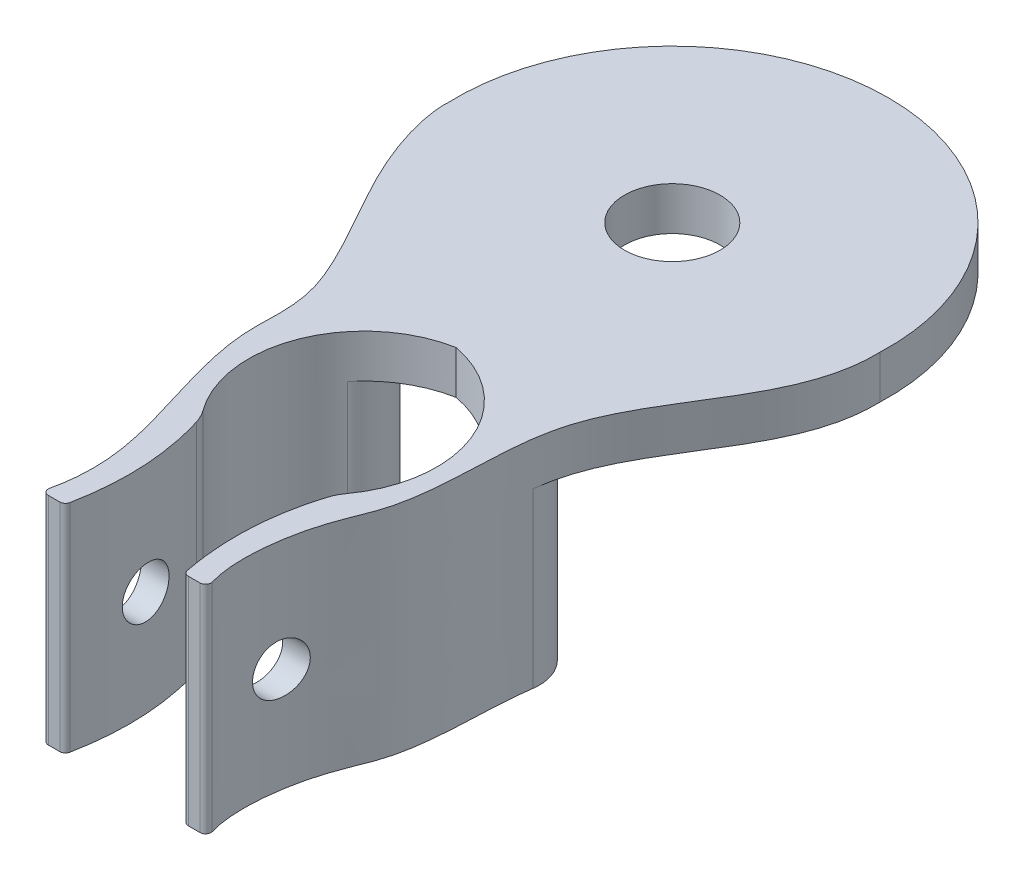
ISO-10303-21;
HEADER;
FILE_DESCRIPTION(('STEP AP214'),'2;1');
FILE_NAME('part.step','',(''),(''),'','','');
FILE_SCHEMA(('AUTOMOTIVE_DESIGN { 1 0 10303 214 1 1 1 1 }'));
ENDSEC;
DATA;
#1=APPLICATION_CONTEXT('core data for automotive mechanical design processes');
#2=APPLICATION_PROTOCOL_DEFINITION('international standard','automotive_design',2000,#1);
#3=PRODUCT_CONTEXT('',#1,'mechanical');
#4=PRODUCT('Part','Part','',(#3));
#5=PRODUCT_RELATED_PRODUCT_CATEGORY('part','',(#4));
#6=PRODUCT_DEFINITION_FORMATION('','',#4);
#7=PRODUCT_DEFINITION_CONTEXT('part definition',#1,'design');
#8=PRODUCT_DEFINITION('design','',#6,#7);
#9=PRODUCT_DEFINITION_SHAPE('','',#8);
#10=(LENGTH_UNIT() NAMED_UNIT(*) SI_UNIT(.MILLI.,.METRE.));
#11=(NAMED_UNIT(*) PLANE_ANGLE_UNIT() SI_UNIT($,.RADIAN.));
#12=(NAMED_UNIT(*) SI_UNIT($,.STERADIAN.) SOLID_ANGLE_UNIT());
#13=UNCERTAINTY_MEASURE_WITH_UNIT(LENGTH_MEASURE(1.E-05),#10,'distance_accuracy_value','');
#14=(GEOMETRIC_REPRESENTATION_CONTEXT(3) GLOBAL_UNCERTAINTY_ASSIGNED_CONTEXT((#13)) GLOBAL_UNIT_ASSIGNED_CONTEXT((#10,
#11,#12)) REPRESENTATION_CONTEXT('',''));
#15=CARTESIAN_POINT('',(0.,0.,0.));
#16=DIRECTION('',(0.,0.,1.));
#17=DIRECTION('',(1.,0.,0.));
#18=AXIS2_PLACEMENT_3D('',#15,#16,#17);
#19=CARTESIAN_POINT('',(-6.93411925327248,12.7,15.7482204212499));
#20=DIRECTION('',(0.,-1.,0.));
#21=DIRECTION('',(0.,0.,-1.));
#22=AXIS2_PLACEMENT_3D('',#19,#20,#21);
#23=PLANE('',#22);
#24=CARTESIAN_POINT('',(-12.6900757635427,12.7,0.50197322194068));
#25=CARTESIAN_POINT('',(-12.7085946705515,12.7,0.534595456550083));
#26=CARTESIAN_POINT('',(-12.9445111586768,12.7,3.81873144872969));
#27=CARTESIAN_POINT('',(-6.44251711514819,12.7,13.8864500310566));
#28=CARTESIAN_POINT('',(-7.36026092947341,12.7,18.4591788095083));
#29=CARTESIAN_POINT('',(-5.27387900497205,12.7,24.7590934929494));
#30=CARTESIAN_POINT('',(-4.15604476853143,12.7,29.0328933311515));
#31=CARTESIAN_POINT('',(-4.77346849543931,12.7,31.7962230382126));
#32=B_SPLINE_CURVE_WITH_KNOTS('',3,(#24,#25,#26,#27,#28,#29,#30,#31),.UNSPECIFIED.,.F.,.F.,(4,1,
1,1,1,4),(0.,0.279659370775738,0.433863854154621,0.566787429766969,0.759908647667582,
0.988953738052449),.UNSPECIFIED.);
#33=CARTESIAN_POINT('',(-12.6900757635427,12.7,0.501973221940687));
#34=VERTEX_POINT('',#33);
#35=CARTESIAN_POINT('',(-4.77346849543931,12.7,31.7962230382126));
#36=VERTEX_POINT('',#35);
#37=EDGE_CURVE('E451',#34,#36,#32,.T.);
#38=ORIENTED_EDGE('',*,*,#37,.T.);
#39=CARTESIAN_POINT('',(-4.45105676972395,12.7,31.8682610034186));
#40=DIRECTION('',(0.,1.,0.));
#41=DIRECTION('',(0.,0.,1.));
#42=AXIS2_PLACEMENT_3D('',#39,#40,#41);
#43=CIRCLE('',#42,0.330361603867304);
#44=CARTESIAN_POINT('',(-4.45105676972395,12.7,32.1986226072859));
#45=VERTEX_POINT('',#44);
#46=EDGE_CURVE('E456',#36,#45,#43,.T.);
#47=ORIENTED_EDGE('',*,*,#46,.T.);
#48=DIRECTION('',(1.,0.,0.));
#49=VECTOR('',#48,1.);
#50=CARTESIAN_POINT('',(-4.45105676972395,12.7,32.1986226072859));
#51=LINE('',#50,#49);
#52=CARTESIAN_POINT('',(-3.77597646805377,12.7,32.1986226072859));
#53=VERTEX_POINT('',#52);
#54=EDGE_CURVE('E459',#45,#53,#51,.T.);
#55=ORIENTED_EDGE('',*,*,#54,.T.);
#56=CARTESIAN_POINT('',(-3.77597646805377,12.7,31.8682610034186));
#57=DIRECTION('',(0.,1.,0.));
#58=DIRECTION('',(0.,0.,-1.));
#59=AXIS2_PLACEMENT_3D('',#56,#57,#58);
#60=CIRCLE('',#59,0.330361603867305);
#61=CARTESIAN_POINT('',(-3.45189480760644,12.7,31.932369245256));
#62=VERTEX_POINT('',#61);
#63=EDGE_CURVE('E328',#53,#62,#60,.T.);
#64=ORIENTED_EDGE('',*,*,#63,.T.);
#65=CARTESIAN_POINT('',(-3.45189480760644,12.7,31.932369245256));
#66=CARTESIAN_POINT('',(-3.03837590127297,12.7,29.8419376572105));
#67=CARTESIAN_POINT('',(-3.0285914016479,12.7,27.2020407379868));
#68=CARTESIAN_POINT('',(-3.6668448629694,12.7,24.6575247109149));
#69=CARTESIAN_POINT('',(-3.83488723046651,12.7,24.1124032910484));
#70=B_SPLINE_CURVE_WITH_KNOTS('',3,(#65,#66,#67,#68,#69),.UNSPECIFIED.,.F.,.F.,(4,1,4),
(0.0550755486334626,0.772138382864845,0.969570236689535),.UNSPECIFIED.);
#71=CARTESIAN_POINT('',(-3.83488723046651,12.7,24.1124032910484));
#72=VERTEX_POINT('',#71);
#73=EDGE_CURVE('E321',#62,#72,#70,.T.);
#74=ORIENTED_EDGE('',*,*,#73,.T.);
#75=CARTESIAN_POINT('',(-6.26217420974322,12.7,24.8606531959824));
#76=DIRECTION('',(0.,1.,0.));
#77=DIRECTION('',(0.,0.,-1.));
#78=AXIS2_PLACEMENT_3D('',#75,#76,#77);
#79=CIRCLE('',#78,2.54);
#80=CARTESIAN_POINT('',(-4.21241176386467,12.7,23.3606285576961));
#81=VERTEX_POINT('',#80);
#82=EDGE_CURVE('E327',#72,#81,#79,.T.);
#83=ORIENTED_EDGE('',*,*,#82,.T.);
#84=CARTESIAN_POINT('',(1.25597785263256,12.7,19.3588384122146));
#85=DIRECTION('',(0.,-1.,0.));
#86=DIRECTION('',(0.,0.,1.));
#87=AXIS2_PLACEMENT_3D('',#84,#85,#86);
#88=CIRCLE('',#87,6.77625334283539);
#89=CARTESIAN_POINT('',(0.,12.7,12.7));
#90=VERTEX_POINT('',#89);
#91=EDGE_CURVE('E334',#81,#90,#88,.T.);
#92=ORIENTED_EDGE('',*,*,#91,.T.);
#93=CARTESIAN_POINT('',(-1.25597785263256,12.7,19.3588384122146));
#94=DIRECTION('',(0.,-1.,0.));
#95=DIRECTION('',(0.,0.,-1.));
#96=AXIS2_PLACEMENT_3D('',#93,#94,#95);
#97=CIRCLE('',#96,6.77625334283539);
#98=CARTESIAN_POINT('',(4.21241176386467,12.7,23.3606285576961));
#99=VERTEX_POINT('',#98);
#100=EDGE_CURVE('E336',#90,#99,#97,.T.);
#101=ORIENTED_EDGE('',*,*,#100,.T.);
#102=CARTESIAN_POINT('',(6.26217420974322,12.7,24.8606531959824));
#103=DIRECTION('',(0.,1.,0.));
#104=DIRECTION('',(0.,0.,1.));
#105=AXIS2_PLACEMENT_3D('',#102,#103,#104);
#106=CIRCLE('',#105,2.54);
#107=CARTESIAN_POINT('',(3.83488723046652,12.7,24.1124032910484));
#108=VERTEX_POINT('',#107);
#109=EDGE_CURVE('E338',#99,#108,#106,.T.);
#110=ORIENTED_EDGE('',*,*,#109,.T.);
#111=CARTESIAN_POINT('',(3.83488723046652,12.7,24.1124032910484));
#112=CARTESIAN_POINT('',(3.66684486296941,12.7,24.6575247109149));
#113=CARTESIAN_POINT('',(3.02859140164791,12.7,27.2020407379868));
#114=CARTESIAN_POINT('',(3.03837590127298,12.7,29.8419376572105));
#115=CARTESIAN_POINT('',(3.45189480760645,12.7,31.932369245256));
#116=B_SPLINE_CURVE_WITH_KNOTS('',3,(#111,#112,#113,#114,#115),.UNSPECIFIED.,.F.,.F.,(4,1,4),
(0.0550755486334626,0.252507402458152,0.969570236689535),.UNSPECIFIED.);
#117=CARTESIAN_POINT('',(3.45189480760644,12.7,31.932369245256));
#118=VERTEX_POINT('',#117);
#119=EDGE_CURVE('E340',#108,#118,#116,.T.);
#120=ORIENTED_EDGE('',*,*,#119,.T.);
#121=CARTESIAN_POINT('',(3.77597646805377,12.7,31.8682610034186));
#122=DIRECTION('',(0.,1.,0.));
#123=DIRECTION('',(0.,0.,1.));
#124=AXIS2_PLACEMENT_3D('',#121,#122,#123);
#125=CIRCLE('',#124,0.330361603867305);
#126=CARTESIAN_POINT('',(3.77597646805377,12.7,32.1986226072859));
#127=VERTEX_POINT('',#126);
#128=EDGE_CURVE('E345',#118,#127,#125,.T.);
#129=ORIENTED_EDGE('',*,*,#128,.T.);
#130=DIRECTION('',(1.,0.,0.));
#131=VECTOR('',#130,1.);
#132=CARTESIAN_POINT('',(4.45105676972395,12.7,32.1986226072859));
#133=LINE('',#132,#131);
#134=CARTESIAN_POINT('',(4.45105676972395,12.7,32.1986226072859));
#135=VERTEX_POINT('',#134);
#136=EDGE_CURVE('E500',#127,#135,#133,.T.);
#137=ORIENTED_EDGE('',*,*,#136,.T.);
#138=CARTESIAN_POINT('',(4.45105676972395,12.7,31.8682610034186));
#139=DIRECTION('',(0.,1.,0.));
#140=DIRECTION('',(0.,0.,-1.));
#141=AXIS2_PLACEMENT_3D('',#138,#139,#140);
#142=CIRCLE('',#141,0.330361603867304);
#143=CARTESIAN_POINT('',(4.77346849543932,12.7,31.7962230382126));
#144=VERTEX_POINT('',#143);
#145=EDGE_CURVE('E402',#135,#144,#142,.T.);
#146=ORIENTED_EDGE('',*,*,#145,.T.);
#147=CARTESIAN_POINT('',(4.77346849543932,12.7,31.7962230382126));
#148=CARTESIAN_POINT('',(4.26261652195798,12.7,30.1479997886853));
#149=CARTESIAN_POINT('',(4.52523901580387,12.7,26.6602313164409));
#150=CARTESIAN_POINT('',(7.08560364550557,12.7,20.9954102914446));
#151=CARTESIAN_POINT('',(5.48854782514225,12.7,11.2875043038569));
#152=CARTESIAN_POINT('',(12.8342449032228,12.7,5.63803468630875));
#153=CARTESIAN_POINT('',(12.6900757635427,12.7,0.501973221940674));
#154=B_SPLINE_CURVE_WITH_KNOTS('',3,(#147,#148,#149,#150,#151,#152,#153),.UNSPECIFIED.,.F.,.F.,
(4,1,1,1,4),(0.,0.239032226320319,0.296991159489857,0.579589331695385,1.),.UNSPECIFIED.);
#155=CARTESIAN_POINT('',(12.6900757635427,12.7,0.501973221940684));
#156=VERTEX_POINT('',#155);
#157=EDGE_CURVE('E396',#144,#156,#154,.T.);
#158=ORIENTED_EDGE('',*,*,#157,.T.);
#159=CARTESIAN_POINT('',(0.,12.7,0.));
#160=DIRECTION('',(0.,1.,0.));
#161=DIRECTION('',(0.,0.,-1.));
#162=AXIS2_PLACEMENT_3D('',#159,#160,#161);
#163=CIRCLE('',#162,12.7);
#164=EDGE_CURVE('E201',#156,#34,#163,.T.);
#165=ORIENTED_EDGE('',*,*,#164,.T.);
#166=EDGE_LOOP('',(#38,#47,#55,#64,#74,#83,#92,#101,#110,#120,#129,#137,#146,#158,#165));
#167=FACE_BOUND('',#166,.T.);
#168=CARTESIAN_POINT('',(0.,12.7,0.));
#169=DIRECTION('',(0.,1.,0.));
#170=DIRECTION('',(0.,0.,1.));
#171=AXIS2_PLACEMENT_3D('',#168,#169,#170);
#172=CIRCLE('',#171,2.8067);
#173=CARTESIAN_POINT('',(0.,12.7,2.8067));
#174=VERTEX_POINT('',#173);
#175=EDGE_CURVE('E559',#174,#174,#172,.T.);
#176=ORIENTED_EDGE('',*,*,#175,.F.);
#177=EDGE_LOOP('',(#176));
#178=FACE_BOUND('',#177,.T.);
#179=ADVANCED_FACE('F33',(#167,#178),#23,.F.);
#180=CARTESIAN_POINT('',(-6.93411925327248,0.,15.7482204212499));
#181=DIRECTION('',(0.,-1.,0.));
#182=DIRECTION('',(0.,0.,-1.));
#183=AXIS2_PLACEMENT_3D('',#180,#181,#182);
#184=PLANE('',#183);
#185=CARTESIAN_POINT('',(-4.47025085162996,0.,14.7024333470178));
#186=DIRECTION('',(0.,-1.,0.));
#187=DIRECTION('',(0.,0.,-1.));
#188=AXIS2_PLACEMENT_3D('',#185,#186,#187);
#189=CIRCLE('',#188,2.54);
#190=CARTESIAN_POINT('',(-6.99147324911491,0.,15.0107150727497));
#191=VERTEX_POINT('',#190);
#192=CARTESIAN_POINT('',(-3.73136641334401,0.,12.2722790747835));
#193=VERTEX_POINT('',#192);
#194=EDGE_CURVE('E258',#191,#193,#189,.T.);
#195=ORIENTED_EDGE('',*,*,#194,.T.);
#196=CARTESIAN_POINT('',(-5.96798757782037,0.,13.4760754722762));
#197=DIRECTION('',(0.,-1.,0.));
#198=DIRECTION('',(0.,0.,-1.));
#199=AXIS2_PLACEMENT_3D('',#196,#197,#198);
#200=CIRCLE('',#199,2.54);
#201=CARTESIAN_POINT('',(-3.99843270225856,0.,15.0799624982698));
#202=VERTEX_POINT('',#201);
#203=EDGE_CURVE('E263',#193,#202,#200,.T.);
#204=ORIENTED_EDGE('',*,*,#203,.T.);
#205=CARTESIAN_POINT('',(1.25597785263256,0.,19.3588384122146));
#206=DIRECTION('',(0.,-1.,0.));
#207=DIRECTION('',(0.,0.,1.));
#208=AXIS2_PLACEMENT_3D('',#205,#206,#207);
#209=CIRCLE('',#208,6.77625334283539);
#210=CARTESIAN_POINT('',(-4.21241176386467,0.,23.3606285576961));
#211=VERTEX_POINT('',#210);
#212=EDGE_CURVE('E430',#211,#202,#209,.T.);
#213=ORIENTED_EDGE('',*,*,#212,.F.);
#214=CARTESIAN_POINT('',(-6.26217420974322,0.,24.8606531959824));
#215=DIRECTION('',(0.,1.,0.));
#216=DIRECTION('',(0.,0.,-1.));
#217=AXIS2_PLACEMENT_3D('',#214,#215,#216);
#218=CIRCLE('',#217,2.54);
#219=CARTESIAN_POINT('',(-3.83488723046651,0.,24.1124032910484));
#220=VERTEX_POINT('',#219);
#221=EDGE_CURVE('E425',#220,#211,#218,.T.);
#222=ORIENTED_EDGE('',*,*,#221,.F.);
#223=CARTESIAN_POINT('',(-3.45189480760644,0.,31.932369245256));
#224=CARTESIAN_POINT('',(-3.03837590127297,0.,29.8419376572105));
#225=CARTESIAN_POINT('',(-3.0285914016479,0.,27.2020407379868));
#226=CARTESIAN_POINT('',(-3.6668448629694,0.,24.6575247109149));
#227=CARTESIAN_POINT('',(-3.83488723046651,0.,24.1124032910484));
#228=B_SPLINE_CURVE_WITH_KNOTS('',3,(#223,#224,#225,#226,#227),.UNSPECIFIED.,.F.,.F.,(4,1,4),
(0.0550755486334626,0.772138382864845,0.969570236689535),.UNSPECIFIED.);
#229=CARTESIAN_POINT('',(-3.45189480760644,0.,31.932369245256));
#230=VERTEX_POINT('',#229);
#231=EDGE_CURVE('E421',#230,#220,#228,.T.);
#232=ORIENTED_EDGE('',*,*,#231,.F.);
#233=CARTESIAN_POINT('',(-3.77597646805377,0.,31.8682610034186));
#234=DIRECTION('',(0.,1.,0.));
#235=DIRECTION('',(0.,0.,-1.));
#236=AXIS2_PLACEMENT_3D('',#233,#234,#235);
#237=CIRCLE('',#236,0.330361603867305);
#238=CARTESIAN_POINT('',(-3.77597646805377,0.,32.1986226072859));
#239=VERTEX_POINT('',#238);
#240=EDGE_CURVE('E419',#239,#230,#237,.T.);
#241=ORIENTED_EDGE('',*,*,#240,.F.);
#242=DIRECTION('',(1.,0.,0.));
#243=VECTOR('',#242,1.);
#244=CARTESIAN_POINT('',(-4.45105676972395,0.,32.1986226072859));
#245=LINE('',#244,#243);
#246=CARTESIAN_POINT('',(-4.45105676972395,0.,32.1986226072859));
#247=VERTEX_POINT('',#246);
#248=EDGE_CURVE('E417',#247,#239,#245,.T.);
#249=ORIENTED_EDGE('',*,*,#248,.F.);
#250=CARTESIAN_POINT('',(-4.45105676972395,0.,31.8682610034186));
#251=DIRECTION('',(0.,1.,0.));
#252=DIRECTION('',(0.,0.,1.));
#253=AXIS2_PLACEMENT_3D('',#250,#251,#252);
#254=CIRCLE('',#253,0.330361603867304);
#255=CARTESIAN_POINT('',(-4.77346849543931,0.,31.7962230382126));
#256=VERTEX_POINT('',#255);
#257=EDGE_CURVE('E411',#256,#247,#254,.T.);
#258=ORIENTED_EDGE('',*,*,#257,.F.);
#259=CARTESIAN_POINT('',(-12.6900757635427,0.,0.50197322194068));
#260=CARTESIAN_POINT('',(-12.7085946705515,0.,0.534595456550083));
#261=CARTESIAN_POINT('',(-12.9445111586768,0.,3.81873144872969));
#262=CARTESIAN_POINT('',(-6.44251711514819,0.,13.8864500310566));
#263=CARTESIAN_POINT('',(-7.36026092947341,0.,18.4591788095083));
#264=CARTESIAN_POINT('',(-5.27387900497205,0.,24.7590934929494));
#265=CARTESIAN_POINT('',(-4.15604476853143,0.,29.0328933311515));
#266=CARTESIAN_POINT('',(-4.77346849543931,0.,31.7962230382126));
#267=B_SPLINE_CURVE_WITH_KNOTS('',3,(#259,#260,#261,#262,#263,#264,#265,#266),.UNSPECIFIED.,.F.,
.F.,(4,1,1,1,1,4),(0.,0.279659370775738,0.433863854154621,0.566787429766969,0.759908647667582,
0.988953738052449),.UNSPECIFIED.);
#268=EDGE_CURVE('E407',#191,#256,#267,.T.);
#269=ORIENTED_EDGE('',*,*,#268,.F.);
#270=EDGE_LOOP('',(#195,#204,#213,#222,#232,#241,#249,#258,#269));
#271=FACE_BOUND('',#270,.T.);
#272=ADVANCED_FACE('F370',(#271),#184,.T.);
#273=DIRECTION('',(0.,-1.,0.));
#274=VECTOR('',#273,1.);
#275=SURFACE_OF_LINEAR_EXTRUSION('',#32,#274);
#276=CARTESIAN_POINT('',(-4.95633280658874,6.16582696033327,26.2198274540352));
#277=CARTESIAN_POINT('',(-4.95633093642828,6.24700173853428,26.2198332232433));
#278=CARTESIAN_POINT('',(-4.95468988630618,6.32825554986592,26.2265713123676));
#279=CARTESIAN_POINT('',(-4.94984501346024,6.44829752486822,26.2465882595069));
#280=CARTESIAN_POINT('',(-4.94783030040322,6.48803576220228,26.2549227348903));
#281=CARTESIAN_POINT('',(-4.94303519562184,6.56668331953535,26.2748321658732));
#282=CARTESIAN_POINT('',(-4.94025417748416,6.60559193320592,26.2864097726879));
#283=CARTESIAN_POINT('',(-4.93082928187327,6.72045100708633,26.3258242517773));
#284=CARTESIAN_POINT('',(-4.92309473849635,6.79474723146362,26.3583785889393));
#285=CARTESIAN_POINT('',(-4.90513999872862,6.93677734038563,26.4350646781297));
#286=CARTESIAN_POINT('',(-4.89491932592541,7.00450996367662,26.4791986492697));
#287=CARTESIAN_POINT('',(-4.8780643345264,7.10031269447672,26.5534114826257));
#288=CARTESIAN_POINT('',(-4.87214051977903,7.13149723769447,26.5797179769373));
#289=CARTESIAN_POINT('',(-4.85988117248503,7.19150813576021,26.6347494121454));
#290=CARTESIAN_POINT('',(-4.85354604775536,7.22033676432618,26.6634719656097));
#291=CARTESIAN_POINT('',(-4.83403048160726,7.3030778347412,26.7530398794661));
#292=CARTESIAN_POINT('',(-4.82033748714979,7.35325866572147,26.8172957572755));
#293=CARTESIAN_POINT('',(-4.79194668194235,7.44340495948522,26.954756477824));
#294=CARTESIAN_POINT('',(-4.77723230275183,7.48308343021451,27.0281449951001));
#295=CARTESIAN_POINT('',(-4.7478441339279,7.54952543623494,27.1805759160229));
#296=CARTESIAN_POINT('',(-4.73317034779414,7.57628789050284,27.2596187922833));
#297=CARTESIAN_POINT('',(-4.70439156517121,7.61634436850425,27.4221089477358));
#298=CARTESIAN_POINT('',(-4.69029466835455,7.62948593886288,27.5055953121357));
#299=CARTESIAN_POINT('',(-4.66344952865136,7.64131172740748,27.6738028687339));
#300=CARTESIAN_POINT('',(-4.6507012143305,7.6399967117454,27.7585239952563));
#301=CARTESIAN_POINT('',(-4.62710919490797,7.62290283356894,27.9259812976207));
#302=CARTESIAN_POINT('',(-4.61624936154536,7.60725441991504,28.0087284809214));
#303=CARTESIAN_POINT('',(-4.59654475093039,7.56201088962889,28.1705694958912));
#304=CARTESIAN_POINT('',(-4.5876997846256,7.53241708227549,28.249663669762));
#305=CARTESIAN_POINT('',(-4.57219484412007,7.46064779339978,28.4005773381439));
#306=CARTESIAN_POINT('',(-4.56550202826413,7.41868223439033,28.4724933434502));
#307=CARTESIAN_POINT('',(-4.55397270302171,7.32316274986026,28.6083335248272));
#308=CARTESIAN_POINT('',(-4.54913611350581,7.26960932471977,28.6722580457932));
#309=CARTESIAN_POINT('',(-4.54107983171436,7.15291119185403,28.7897424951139));
#310=CARTESIAN_POINT('',(-4.53784746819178,7.0898469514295,28.8433815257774));
#311=CARTESIAN_POINT('',(-4.53260550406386,6.9556019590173,28.9393752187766));
#312=CARTESIAN_POINT('',(-4.53059590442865,6.88442120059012,28.9817298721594));
#313=CARTESIAN_POINT('',(-4.52746056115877,6.73592427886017,29.0539565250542));
#314=CARTESIAN_POINT('',(-4.52633526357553,6.65860504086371,29.0838222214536));
#315=CARTESIAN_POINT('',(-4.52469256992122,6.50005194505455,29.1301893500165));
#316=CARTESIAN_POINT('',(-4.52417517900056,6.41881805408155,29.1466906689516));
#317=CARTESIAN_POINT('',(-4.5235805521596,6.25457859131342,29.1658783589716));
#318=CARTESIAN_POINT('',(-4.52350414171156,6.17156998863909,29.1685388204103));
#319=CARTESIAN_POINT('',(-4.52376568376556,6.0062827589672,29.1598991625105));
#320=CARTESIAN_POINT('',(-4.52410363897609,5.92400413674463,29.1485989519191));
#321=CARTESIAN_POINT('',(-4.52531127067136,5.76247392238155,29.1123509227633));
#322=CARTESIAN_POINT('',(-4.52618119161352,5.68322373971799,29.0873968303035));
#323=CARTESIAN_POINT('',(-4.52869534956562,5.53004418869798,29.0245498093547));
#324=CARTESIAN_POINT('',(-4.53033958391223,5.45611480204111,28.9866569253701));
#325=CARTESIAN_POINT('',(-4.5347255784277,5.315737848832,28.8990565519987));
#326=CARTESIAN_POINT('',(-4.53746648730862,5.24928453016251,28.8493582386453));
#327=CARTESIAN_POINT('',(-4.54439265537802,5.12568716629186,28.7395737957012));
#328=CARTESIAN_POINT('',(-4.54857787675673,5.0685428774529,28.6794879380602));
#329=CARTESIAN_POINT('',(-4.55868346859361,4.96528612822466,28.5508211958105));
#330=CARTESIAN_POINT('',(-4.5646002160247,4.91915099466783,28.4822582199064));
#331=CARTESIAN_POINT('',(-4.57836141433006,4.83902980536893,28.3385472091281));
#332=CARTESIAN_POINT('',(-4.58620583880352,4.80504358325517,28.2633992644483));
#333=CARTESIAN_POINT('',(-4.60386021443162,4.75008054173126,28.1086349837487));
#334=CARTESIAN_POINT('',(-4.61367186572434,4.72911503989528,28.0290148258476));
#335=CARTESIAN_POINT('',(-4.63510249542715,4.70071797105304,27.8676361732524));
#336=CARTESIAN_POINT('',(-4.64672157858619,4.69328718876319,27.7858775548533));
#337=CARTESIAN_POINT('',(-4.67156280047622,4.69204470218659,27.6216286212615));
#338=CARTESIAN_POINT('',(-4.6848003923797,4.69837582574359,27.5391395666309));
#339=CARTESIAN_POINT('',(-4.71227529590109,4.72466608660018,27.3765440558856));
#340=CARTESIAN_POINT('',(-4.72651271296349,4.74462666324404,27.2964378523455));
#341=CARTESIAN_POINT('',(-4.75560874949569,4.79804313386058,27.1394370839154));
#342=CARTESIAN_POINT('',(-4.77047368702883,4.83171169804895,27.0626152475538));
#343=CARTESIAN_POINT('',(-4.79250147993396,4.89156529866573,26.9525368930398));
#344=CARTESIAN_POINT('',(-4.79980055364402,4.91308011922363,26.9166966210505));
#345=CARTESIAN_POINT('',(-4.81422874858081,4.95911590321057,26.8469095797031));
#346=CARTESIAN_POINT('',(-4.82135768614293,4.98363995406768,26.8129648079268));
#347=CARTESIAN_POINT('',(-4.84240612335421,5.06173030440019,26.714069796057));
#348=CARTESIAN_POINT('',(-4.85592141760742,5.11963802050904,26.6523839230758));
#349=CARTESIAN_POINT('',(-4.88109901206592,5.24537960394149,26.5396758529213));
#350=CARTESIAN_POINT('',(-4.89276166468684,5.31321157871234,26.4886516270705));
#351=CARTESIAN_POINT('',(-4.908284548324,5.42040035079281,26.4216479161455));
#352=CARTESIAN_POINT('',(-4.91310441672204,5.45677478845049,26.4010094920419));
#353=CARTESIAN_POINT('',(-4.92206046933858,5.53117479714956,26.3628837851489));
#354=CARTESIAN_POINT('',(-4.92619724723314,5.56919889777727,26.3453937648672));
#355=CARTESIAN_POINT('',(-4.93748410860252,5.68533852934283,26.2978861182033));
#356=CARTESIAN_POINT('',(-4.94352972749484,5.76565119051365,26.2727497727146));
#357=CARTESIAN_POINT('',(-4.95069263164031,5.89970092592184,26.2430743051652));
#358=CARTESIAN_POINT('',(-4.95280201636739,5.95251744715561,26.2343717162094));
#359=CARTESIAN_POINT('',(-4.95562270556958,6.05882018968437,26.2227464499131));
#360=CARTESIAN_POINT('',(-4.95633403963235,6.11230639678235,26.2198236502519));
#361=CARTESIAN_POINT('',(-4.95633280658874,6.16582696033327,26.2198274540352));
#362=B_SPLINE_CURVE_WITH_KNOTS('',3,(#276,#277,#278,#279,#280,#281,#282,#283,#284,#285,#286,
#287,#288,#289,#290,#291,#292,#293,#294,#295,#296,#297,#298,#299,#300,#301,#302,#303,#304,#305,
#306,#307,#308,#309,#310,#311,#312,#313,#314,#315,#316,#317,#318,#319,#320,#321,#322,#323,#324,
#325,#326,#327,#328,#329,#330,#331,#332,#333,#334,#335,#336,#337,#338,#339,#340,#341,#342,#343,
#344,#345,#346,#347,#348,#349,#350,#351,#352,#353,#354,#355,#356,#357,#358,#359,#360,#361),
.UNSPECIFIED.,.T.,.F.,(4,2,2,2,2,2,2,2,2,2,2,2,2,2,2,2,2,2,2,2,2,2,2,2,2,2,2,2,2,2,2,2,2,2,2,2,
2,2,2,2,2,2,4),(0.,0.24329340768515,0.365133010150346,0.487072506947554,0.730312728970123,
0.973599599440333,1.09715425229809,1.2205882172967,1.46740609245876,1.7203991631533,
1.97341340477,2.22922992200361,2.48503288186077,2.73853065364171,2.99200463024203,
3.24140354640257,3.49079169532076,3.73817734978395,3.98556320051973,4.23307375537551,
4.48058640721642,4.72856222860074,4.97653967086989,5.22463115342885,5.47272178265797,
5.72062020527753,5.96851213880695,6.21588904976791,6.46326257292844,6.71085081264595,
6.95845340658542,7.20863800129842,7.4588490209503,7.71309952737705,7.84027490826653,
7.96758187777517,8.22330883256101,8.47898708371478,8.60514352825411,8.73118974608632,
8.98282541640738,9.14323824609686,9.30364768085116),.UNSPECIFIED.);
#363=CARTESIAN_POINT('',(-4.95633280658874,6.16582696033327,26.2198274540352));
#364=VERTEX_POINT('',#363);
#365=EDGE_CURVE('E271',#364,#364,#362,.T.);
#366=ORIENTED_EDGE('',*,*,#365,.T.);
#367=EDGE_LOOP('',(#366));
#368=FACE_BOUND('',#367,.T.);
#369=CARTESIAN_POINT('',(-12.6900757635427,10.16,0.50197322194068));
#370=CARTESIAN_POINT('',(-12.7085946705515,10.16,0.534595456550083));
#371=CARTESIAN_POINT('',(-12.9445111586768,10.16,3.81873144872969));
#372=CARTESIAN_POINT('',(-6.44251711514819,10.16,13.8864500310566));
#373=CARTESIAN_POINT('',(-7.36026092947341,10.16,18.4591788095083));
#374=CARTESIAN_POINT('',(-5.27387900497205,10.16,24.7590934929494));
#375=CARTESIAN_POINT('',(-4.15604476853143,10.16,29.0328933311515));
#376=CARTESIAN_POINT('',(-4.77346849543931,10.16,31.7962230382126));
#377=B_SPLINE_CURVE_WITH_KNOTS('',3,(#369,#370,#371,#372,#373,#374,#375,#376),.UNSPECIFIED.,.F.,
.F.,(4,1,1,1,1,4),(0.,0.279659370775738,0.433863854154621,0.566787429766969,0.759908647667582,
0.988953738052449),.UNSPECIFIED.);
#378=CARTESIAN_POINT('',(-12.6900757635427,10.16,0.501973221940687));
#379=VERTEX_POINT('',#378);
#380=CARTESIAN_POINT('',(-6.99147324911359,10.16,15.0107150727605));
#381=VERTEX_POINT('',#380);
#382=EDGE_CURVE('E182',#379,#381,#377,.T.);
#383=ORIENTED_EDGE('',*,*,#382,.T.);
#384=DIRECTION('',(0.,-1.,0.));
#385=VECTOR('',#384,1.);
#386=CARTESIAN_POINT('',(-6.99147324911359,10.16,15.0107150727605));
#387=LINE('',#386,#385);
#388=EDGE_CURVE('E256',#381,#191,#387,.T.);
#389=ORIENTED_EDGE('',*,*,#388,.T.);
#390=ORIENTED_EDGE('',*,*,#268,.T.);
#391=DIRECTION('',(0.,-1.,0.));
#392=VECTOR('',#391,1.);
#393=CARTESIAN_POINT('',(-4.77346849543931,12.7,31.7962230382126));
#394=LINE('',#393,#392);
#395=EDGE_CURVE('E242',#36,#256,#394,.T.);
#396=ORIENTED_EDGE('',*,*,#395,.F.);
#397=ORIENTED_EDGE('',*,*,#37,.F.);
#398=DIRECTION('',(0.,-1.,0.));
#399=VECTOR('',#398,1.);
#400=CARTESIAN_POINT('',(-12.6900757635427,12.7,0.501973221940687));
#401=LINE('',#400,#399);
#402=EDGE_CURVE('E203',#34,#379,#401,.T.);
#403=ORIENTED_EDGE('',*,*,#402,.T.);
#404=EDGE_LOOP('',(#383,#389,#390,#396,#397,#403));
#405=FACE_BOUND('',#404,.T.);
#406=ADVANCED_FACE('F278',(#368,#405),#275,.F.);
#407=CARTESIAN_POINT('',(1.25597785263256,12.7,19.3588384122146));
#408=DIRECTION('',(0.,-1.,0.));
#409=DIRECTION('',(0.,0.,-1.));
#410=AXIS2_PLACEMENT_3D('',#407,#408,#409);
#411=CYLINDRICAL_SURFACE('',#410,6.77625334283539);
#412=ORIENTED_EDGE('',*,*,#212,.T.);
#413=DIRECTION('',(0.,-1.,0.));
#414=VECTOR('',#413,1.);
#415=CARTESIAN_POINT('',(-3.99843270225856,12.7,15.0799624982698));
#416=LINE('',#415,#414);
#417=CARTESIAN_POINT('',(-3.99843270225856,10.16,15.0799624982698));
#418=VERTEX_POINT('',#417);
#419=EDGE_CURVE('E265',#202,#418,#416,.F.);
#420=ORIENTED_EDGE('',*,*,#419,.T.);
#421=CARTESIAN_POINT('',(1.25597785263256,10.16,19.3588384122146));
#422=DIRECTION('',(0.,1.,0.));
#423=DIRECTION('',(0.,0.,1.));
#424=AXIS2_PLACEMENT_3D('',#421,#422,#423);
#425=CIRCLE('',#424,6.77625334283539);
#426=CARTESIAN_POINT('',(0.,10.16,12.7));
#427=VERTEX_POINT('',#426);
#428=EDGE_CURVE('E412',#418,#427,#425,.F.);
#429=ORIENTED_EDGE('',*,*,#428,.T.);
#430=DIRECTION('',(0.,-1.,0.));
#431=VECTOR('',#430,1.);
#432=CARTESIAN_POINT('',(0.,12.7,12.7));
#433=LINE('',#432,#431);
#434=EDGE_CURVE('E225',#90,#427,#433,.T.);
#435=ORIENTED_EDGE('',*,*,#434,.F.);
#436=ORIENTED_EDGE('',*,*,#91,.F.);
#437=DIRECTION('',(0.,-1.,0.));
#438=VECTOR('',#437,1.);
#439=CARTESIAN_POINT('',(-4.21241176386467,12.7,23.3606285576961));
#440=LINE('',#439,#438);
#441=EDGE_CURVE('E227',#81,#211,#440,.T.);
#442=ORIENTED_EDGE('',*,*,#441,.T.);
#443=EDGE_LOOP('',(#412,#420,#429,#435,#436,#442));
#444=FACE_BOUND('',#443,.T.);
#445=ADVANCED_FACE('F364',(#444),#411,.F.);
#446=CARTESIAN_POINT('',(-1.25597785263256,12.7,19.3588384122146));
#447=DIRECTION('',(0.,-1.,0.));
#448=DIRECTION('',(0.,0.,-1.));
#449=AXIS2_PLACEMENT_3D('',#446,#447,#448);
#450=CYLINDRICAL_SURFACE('',#449,6.77625334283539);
#451=CARTESIAN_POINT('',(-1.25597785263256,10.16,19.3588384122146));
#452=DIRECTION('',(0.,1.,0.));
#453=DIRECTION('',(0.,0.,1.));
#454=AXIS2_PLACEMENT_3D('',#451,#452,#453);
#455=CIRCLE('',#454,6.77625334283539);
#456=CARTESIAN_POINT('',(3.97241342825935,10.16,15.0482080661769));
#457=VERTEX_POINT('',#456);
#458=EDGE_CURVE('E50',#427,#457,#455,.F.);
#459=ORIENTED_EDGE('',*,*,#458,.T.);
#460=DIRECTION('',(0.,-1.,0.));
#461=VECTOR('',#460,1.);
#462=CARTESIAN_POINT('',(3.97241342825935,12.7,15.0482080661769));
#463=LINE('',#462,#461);
#464=CARTESIAN_POINT('',(3.97241342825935,0.,15.0482080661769));
#465=VERTEX_POINT('',#464);
#466=EDGE_CURVE('E54',#457,#465,#463,.T.);
#467=ORIENTED_EDGE('',*,*,#466,.T.);
#468=CARTESIAN_POINT('',(-1.25597785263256,0.,19.3588384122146));
#469=DIRECTION('',(0.,-1.,0.));
#470=DIRECTION('',(0.,0.,-1.));
#471=AXIS2_PLACEMENT_3D('',#468,#469,#470);
#472=CIRCLE('',#471,6.77625334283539);
#473=CARTESIAN_POINT('',(4.21241176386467,0.,23.3606285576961));
#474=VERTEX_POINT('',#473);
#475=EDGE_CURVE('E432',#465,#474,#472,.T.);
#476=ORIENTED_EDGE('',*,*,#475,.T.);
#477=DIRECTION('',(0.,-1.,0.));
#478=VECTOR('',#477,1.);
#479=CARTESIAN_POINT('',(4.21241176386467,12.7,23.3606285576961));
#480=LINE('',#479,#478);
#481=EDGE_CURVE('E222',#99,#474,#480,.T.);
#482=ORIENTED_EDGE('',*,*,#481,.F.);
#483=ORIENTED_EDGE('',*,*,#100,.F.);
#484=ORIENTED_EDGE('',*,*,#434,.T.);
#485=EDGE_LOOP('',(#459,#467,#476,#482,#483,#484));
#486=FACE_BOUND('',#485,.T.);
#487=ADVANCED_FACE('F362',(#486),#450,.F.);
#488=DIRECTION('',(0.,-1.,0.));
#489=VECTOR('',#488,1.);
#490=SURFACE_OF_LINEAR_EXTRUSION('',#154,#489);
#491=CARTESIAN_POINT('',(4.95845871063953,6.16582696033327,26.2198274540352));
#492=CARTESIAN_POINT('',(4.95845648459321,6.08479950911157,26.2198332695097));
#493=CARTESIAN_POINT('',(4.95671313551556,6.00369267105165,26.2265473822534));
#494=CARTESIAN_POINT('',(4.9515812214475,5.88387338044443,26.2464895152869));
#495=CARTESIAN_POINT('',(4.94944838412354,5.84420943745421,26.2547926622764));
#496=CARTESIAN_POINT('',(4.94438042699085,5.76571085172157,26.274625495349));
#497=CARTESIAN_POINT('',(4.94144465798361,5.72687690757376,26.2861577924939));
#498=CARTESIAN_POINT('',(4.93151565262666,5.61225019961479,26.3254107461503));
#499=CARTESIAN_POINT('',(4.92339080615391,5.53810931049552,26.3578250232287));
#500=CARTESIAN_POINT('',(4.90463187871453,5.39635927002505,26.4341701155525));
#501=CARTESIAN_POINT('',(4.89399726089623,5.32875152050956,26.478103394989));
#502=CARTESIAN_POINT('',(4.87654497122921,5.23301634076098,26.5520403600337));
#503=CARTESIAN_POINT('',(4.87041646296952,5.20180090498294,26.5782942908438));
#504=CARTESIAN_POINT('',(4.85776718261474,5.14172291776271,26.6332234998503));
#505=CARTESIAN_POINT('',(4.85124680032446,5.11285809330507,26.6618963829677));
#506=CARTESIAN_POINT('',(4.83121393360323,5.02999863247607,26.7513227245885));
#507=CARTESIAN_POINT('',(4.81722734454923,4.97972615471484,26.8154938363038));
#508=CARTESIAN_POINT('',(4.78834285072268,4.88930263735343,26.952922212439));
#509=CARTESIAN_POINT('',(4.77343060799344,4.84945588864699,27.0263755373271));
#510=CARTESIAN_POINT('',(4.74375116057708,4.78270859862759,27.1789889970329));
#511=CARTESIAN_POINT('',(4.72898396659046,4.75580900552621,27.2581495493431));
#512=CARTESIAN_POINT('',(4.70008899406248,4.71555381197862,27.4207926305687));
#513=CARTESIAN_POINT('',(4.68596872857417,4.70233092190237,27.5043093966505));
#514=CARTESIAN_POINT('',(4.65905230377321,4.69035619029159,27.6725875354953));
#515=CARTESIAN_POINT('',(4.64625607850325,4.6916036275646,27.7573488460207));
#516=CARTESIAN_POINT('',(4.62248192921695,4.7085721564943,27.9248639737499));
#517=CARTESIAN_POINT('',(4.61148826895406,4.7241591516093,28.0076291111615));
#518=CARTESIAN_POINT('',(4.59139006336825,4.76927992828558,28.1695070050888));
#519=CARTESIAN_POINT('',(4.58228535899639,4.79881253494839,28.2486200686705));
#520=CARTESIAN_POINT('',(4.56613190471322,4.87050792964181,28.3996769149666));
#521=CARTESIAN_POINT('',(4.55905473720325,4.91247744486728,28.4717094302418));
#522=CARTESIAN_POINT('',(4.5466782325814,5.00803989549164,28.6077719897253));
#523=CARTESIAN_POINT('',(4.54137881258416,5.06163228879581,28.6718024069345));
#524=CARTESIAN_POINT('',(4.53238140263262,5.17843369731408,28.7894713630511));
#525=CARTESIAN_POINT('',(4.52867064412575,5.24156030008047,28.8431907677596));
#526=CARTESIAN_POINT('',(4.52251523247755,5.37595870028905,28.9393228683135));
#527=CARTESIAN_POINT('',(4.52007057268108,5.44723045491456,28.9817356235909));
#528=CARTESIAN_POINT('',(4.51616716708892,5.59583696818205,29.0540018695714));
#529=CARTESIAN_POINT('',(4.51470768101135,5.67316712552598,29.0838647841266));
#530=CARTESIAN_POINT('',(4.51253618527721,5.83174552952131,29.1302233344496));
#531=CARTESIAN_POINT('',(4.51182418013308,5.9129937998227,29.1467188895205));
#532=CARTESIAN_POINT('',(4.51100322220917,6.07721570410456,29.1658849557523));
#533=CARTESIAN_POINT('',(4.51089505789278,6.16019145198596,29.1685373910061));
#534=CARTESIAN_POINT('',(4.51125973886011,6.32541215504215,29.1598928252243));
#535=CARTESIAN_POINT('',(4.51173258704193,6.40765710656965,29.1485957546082));
#536=CARTESIAN_POINT('',(4.51336065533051,6.56911727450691,29.1123665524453));
#537=CARTESIAN_POINT('',(4.51451616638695,6.64833118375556,29.0874286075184));
#538=CARTESIAN_POINT('',(4.51771634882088,6.80143947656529,29.024628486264));
#539=CARTESIAN_POINT('',(4.5197610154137,6.87533388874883,28.9867663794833));
#540=CARTESIAN_POINT('',(4.52500919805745,7.01565075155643,28.8992406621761));
#541=CARTESIAN_POINT('',(4.52821190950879,7.0820783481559,28.8495852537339));
#542=CARTESIAN_POINT('',(4.53605912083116,7.20563248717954,28.7399020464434));
#543=CARTESIAN_POINT('',(4.54070359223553,7.26275921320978,28.679874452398));
#544=CARTESIAN_POINT('',(4.55166591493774,7.36603739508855,28.5512843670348));
#545=CARTESIAN_POINT('',(4.55798161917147,7.41220278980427,28.4827328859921));
#546=CARTESIAN_POINT('',(4.57243330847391,7.49238589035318,28.3390377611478));
#547=CARTESIAN_POINT('',(4.58056928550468,7.52640364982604,28.2638941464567));
#548=CARTESIAN_POINT('',(4.59869529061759,7.58146295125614,28.1090326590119));
#549=CARTESIAN_POINT('',(4.60868909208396,7.60247770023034,28.0293057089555));
#550=CARTESIAN_POINT('',(4.63038584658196,7.63093564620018,27.8676945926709));
#551=CARTESIAN_POINT('',(4.6420888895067,7.63837812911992,27.7858103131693));
#552=CARTESIAN_POINT('',(4.66704632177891,7.63960045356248,27.6213301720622));
#553=CARTESIAN_POINT('',(4.68031518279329,7.63324157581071,27.5387354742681));
#554=CARTESIAN_POINT('',(4.70786966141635,7.60686158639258,27.375942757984));
#555=CARTESIAN_POINT('',(4.72215537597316,7.58683917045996,27.2957449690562));
#556=CARTESIAN_POINT('',(4.75141223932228,7.53330734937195,27.1386885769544));
#557=CARTESIAN_POINT('',(4.76639043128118,7.49960134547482,27.0618975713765));
#558=CARTESIAN_POINT('',(4.78868177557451,7.43970713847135,26.9518814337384));
#559=CARTESIAN_POINT('',(4.79608437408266,7.41818125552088,26.9160644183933));
#560=CARTESIAN_POINT('',(4.81075215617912,7.37212952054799,26.8463281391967));
#561=CARTESIAN_POINT('',(4.81801718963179,7.34760058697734,26.8124108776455));
#562=CARTESIAN_POINT('',(4.83953521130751,7.26946507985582,26.7135508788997));
#563=CARTESIAN_POINT('',(4.85343253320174,7.21151855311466,26.651883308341));
#564=CARTESIAN_POINT('',(4.87945954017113,7.08570544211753,26.5392212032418));
#565=CARTESIAN_POINT('',(4.89158956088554,7.01784074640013,26.4882246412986));
#566=CARTESIAN_POINT('',(4.90781529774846,6.91055265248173,26.4212353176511));
#567=CARTESIAN_POINT('',(4.91287075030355,6.87411281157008,26.400587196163));
#568=CARTESIAN_POINT('',(4.92228305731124,6.79957448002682,26.3624504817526));
#569=CARTESIAN_POINT('',(4.92664051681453,6.76147746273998,26.3449591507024));
#570=CARTESIAN_POINT('',(4.93854689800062,6.64510981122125,26.2974634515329));
#571=CARTESIAN_POINT('',(4.94495028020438,6.564629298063,26.2723541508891));
#572=CARTESIAN_POINT('',(4.95251426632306,6.43065506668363,26.2428465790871));
#573=CARTESIAN_POINT('',(4.95473647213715,6.37809510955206,26.2342294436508));
#574=CARTESIAN_POINT('',(4.95770940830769,6.27231051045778,26.2227180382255));
#575=CARTESIAN_POINT('',(4.95846017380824,6.21908588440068,26.219823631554));
#576=CARTESIAN_POINT('',(4.95845871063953,6.16582696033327,26.2198274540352));
#577=B_SPLINE_CURVE_WITH_KNOTS('',3,(#491,#492,#493,#494,#495,#496,#497,#498,#499,#500,#501,
#502,#503,#504,#505,#506,#507,#508,#509,#510,#511,#512,#513,#514,#515,#516,#517,#518,#519,#520,
#521,#522,#523,#524,#525,#526,#527,#528,#529,#530,#531,#532,#533,#534,#535,#536,#537,#538,#539,
#540,#541,#542,#543,#544,#545,#546,#547,#548,#549,#550,#551,#552,#553,#554,#555,#556,#557,#558,
#559,#560,#561,#562,#563,#564,#565,#566,#567,#568,#569,#570,#571,#572,#573,#574,#575,#576),
.UNSPECIFIED.,.T.,.F.,(4,2,2,2,2,2,2,2,2,2,2,2,2,2,2,2,2,2,2,2,2,2,2,2,2,2,2,2,2,2,2,2,2,2,2,2,
2,2,2,2,2,2,4),(0.,0.242851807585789,0.364472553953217,0.486191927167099,0.728959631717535,
0.971779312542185,1.0953935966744,1.2188868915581,1.46582477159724,1.71932135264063,
1.97283649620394,2.22878915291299,2.48472905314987,2.73829959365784,2.99184877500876,
3.24164773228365,3.49143504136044,3.73917522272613,3.98691410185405,4.23446661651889,
4.48202062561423,4.72989780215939,4.97777621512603,5.22576034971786,5.47374314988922,
5.72155398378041,5.96935992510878,6.21684903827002,6.46433705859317,6.71233334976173,
6.96034268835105,7.21085633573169,7.46139389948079,7.71566617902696,7.84285360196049,
7.97017264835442,8.22612433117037,8.48202734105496,8.60844947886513,8.73476142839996,
8.98691611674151,9.14654516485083,9.30617040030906),.UNSPECIFIED.);
#578=CARTESIAN_POINT('',(4.95845871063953,6.16582696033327,26.2198274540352));
#579=VERTEX_POINT('',#578);
#580=EDGE_CURVE('E277',#579,#579,#577,.T.);
#581=ORIENTED_EDGE('',*,*,#580,.T.);
#582=EDGE_LOOP('',(#581));
#583=FACE_BOUND('',#582,.T.);
#584=CARTESIAN_POINT('',(4.77346849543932,0.,31.7962230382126));
#585=CARTESIAN_POINT('',(4.26261652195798,0.,30.1479997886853));
#586=CARTESIAN_POINT('',(4.52523901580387,0.,26.6602313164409));
#587=CARTESIAN_POINT('',(7.08560364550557,0.,20.9954102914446));
#588=CARTESIAN_POINT('',(5.48854782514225,0.,11.2875043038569));
#589=CARTESIAN_POINT('',(12.8342449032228,0.,5.63803468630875));
#590=CARTESIAN_POINT('',(12.6900757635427,0.,0.501973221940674));
#591=B_SPLINE_CURVE_WITH_KNOTS('',3,(#584,#585,#586,#587,#588,#589,#590),.UNSPECIFIED.,.F.,.F.,
(4,1,1,1,4),(0.,0.239032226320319,0.296991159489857,0.579589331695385,1.),.UNSPECIFIED.);
#592=CARTESIAN_POINT('',(4.77346849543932,0.,31.7962230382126));
#593=VERTEX_POINT('',#592);
#594=CARTESIAN_POINT('',(6.90221502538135,0.,15.0828782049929));
#595=VERTEX_POINT('',#594);
#596=EDGE_CURVE('E448',#593,#595,#591,.T.);
#597=ORIENTED_EDGE('',*,*,#596,.T.);
#598=DIRECTION('',(0.,-1.,0.));
#599=VECTOR('',#598,1.);
#600=CARTESIAN_POINT('',(6.90221502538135,0.,15.0828782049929));
#601=LINE('',#600,#599);
#602=CARTESIAN_POINT('',(6.90221502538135,10.16,15.0828782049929));
#603=VERTEX_POINT('',#602);
#604=EDGE_CURVE('E197',#595,#603,#601,.F.);
#605=ORIENTED_EDGE('',*,*,#604,.T.);
#606=CARTESIAN_POINT('',(4.77346849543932,10.16,31.7962230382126));
#607=CARTESIAN_POINT('',(4.26261652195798,10.16,30.1479997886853));
#608=CARTESIAN_POINT('',(4.52523901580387,10.16,26.6602313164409));
#609=CARTESIAN_POINT('',(7.08560364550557,10.16,20.9954102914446));
#610=CARTESIAN_POINT('',(5.48854782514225,10.16,11.2875043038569));
#611=CARTESIAN_POINT('',(12.8342449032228,10.16,5.63803468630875));
#612=CARTESIAN_POINT('',(12.6900757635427,10.16,0.501973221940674));
#613=B_SPLINE_CURVE_WITH_KNOTS('',3,(#606,#607,#608,#609,#610,#611,#612),.UNSPECIFIED.,.F.,.F.,
(4,1,1,1,4),(0.,0.239032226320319,0.296991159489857,0.579589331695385,1.),.UNSPECIFIED.);
#614=CARTESIAN_POINT('',(12.6900757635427,10.16,0.501973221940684));
#615=VERTEX_POINT('',#614);
#616=EDGE_CURVE('E179',#603,#615,#613,.T.);
#617=ORIENTED_EDGE('',*,*,#616,.T.);
#618=DIRECTION('',(0.,-1.,0.));
#619=VECTOR('',#618,1.);
#620=CARTESIAN_POINT('',(12.6900757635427,12.7,0.501973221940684));
#621=LINE('',#620,#619);
#622=EDGE_CURVE('E194',#156,#615,#621,.T.);
#623=ORIENTED_EDGE('',*,*,#622,.F.);
#624=ORIENTED_EDGE('',*,*,#157,.F.);
#625=DIRECTION('',(0.,-1.,0.));
#626=VECTOR('',#625,1.);
#627=CARTESIAN_POINT('',(4.77346849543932,12.7,31.7962230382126));
#628=LINE('',#627,#626);
#629=EDGE_CURVE('E202',#144,#593,#628,.T.);
#630=ORIENTED_EDGE('',*,*,#629,.T.);
#631=EDGE_LOOP('',(#597,#605,#617,#623,#624,#630));
#632=FACE_BOUND('',#631,.T.);
#633=ADVANCED_FACE('F192',(#583,#632),#490,.F.);
#634=ORIENTED_EDGE('',*,*,#475,.F.);
#635=CARTESIAN_POINT('',(5.93221528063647,0.,13.4324182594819));
#636=DIRECTION('',(0.,-1.,0.));
#637=DIRECTION('',(0.,0.,-1.));
#638=AXIS2_PLACEMENT_3D('',#635,#636,#637);
#639=CIRCLE('',#638,2.54);
#640=CARTESIAN_POINT('',(3.66205072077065,0.,12.293140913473));
#641=VERTEX_POINT('',#640);
#642=EDGE_CURVE('E269',#465,#641,#639,.T.);
#643=ORIENTED_EDGE('',*,*,#642,.T.);
#644=CARTESIAN_POINT('',(4.38720927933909,0.,14.7274262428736));
#645=DIRECTION('',(0.,-1.,0.));
#646=DIRECTION('',(0.,0.,-1.));
#647=AXIS2_PLACEMENT_3D('',#644,#645,#646);
#648=CIRCLE('',#647,2.54);
#649=EDGE_CURVE('E248',#641,#595,#648,.T.);
#650=ORIENTED_EDGE('',*,*,#649,.T.);
#651=ORIENTED_EDGE('',*,*,#596,.F.);
#652=CARTESIAN_POINT('',(4.45105676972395,0.,31.8682610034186));
#653=DIRECTION('',(0.,1.,0.));
#654=DIRECTION('',(0.,0.,-1.));
#655=AXIS2_PLACEMENT_3D('',#652,#653,#654);
#656=CIRCLE('',#655,0.330361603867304);
#657=CARTESIAN_POINT('',(4.45105676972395,0.,32.1986226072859));
#658=VERTEX_POINT('',#657);
#659=EDGE_CURVE('E447',#658,#593,#656,.T.);
#660=ORIENTED_EDGE('',*,*,#659,.F.);
#661=DIRECTION('',(1.,0.,0.));
#662=VECTOR('',#661,1.);
#663=CARTESIAN_POINT('',(4.45105676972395,0.,32.1986226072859));
#664=LINE('',#663,#662);
#665=CARTESIAN_POINT('',(3.77597646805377,0.,32.1986226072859));
#666=VERTEX_POINT('',#665);
#667=EDGE_CURVE('E445',#666,#658,#664,.T.);
#668=ORIENTED_EDGE('',*,*,#667,.F.);
#669=CARTESIAN_POINT('',(3.77597646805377,0.,31.8682610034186));
#670=DIRECTION('',(0.,1.,0.));
#671=DIRECTION('',(0.,0.,1.));
#672=AXIS2_PLACEMENT_3D('',#669,#670,#671);
#673=CIRCLE('',#672,0.330361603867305);
#674=CARTESIAN_POINT('',(3.45189480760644,0.,31.932369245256));
#675=VERTEX_POINT('',#674);
#676=EDGE_CURVE('E440',#675,#666,#673,.T.);
#677=ORIENTED_EDGE('',*,*,#676,.F.);
#678=CARTESIAN_POINT('',(3.83488723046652,0.,24.1124032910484));
#679=CARTESIAN_POINT('',(3.66684486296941,0.,24.6575247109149));
#680=CARTESIAN_POINT('',(3.02859140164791,0.,27.2020407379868));
#681=CARTESIAN_POINT('',(3.03837590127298,0.,29.8419376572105));
#682=CARTESIAN_POINT('',(3.45189480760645,0.,31.932369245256));
#683=B_SPLINE_CURVE_WITH_KNOTS('',3,(#678,#679,#680,#681,#682),.UNSPECIFIED.,.F.,.F.,(4,1,4),
(0.0550755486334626,0.252507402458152,0.969570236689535),.UNSPECIFIED.);
#684=CARTESIAN_POINT('',(3.83488723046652,0.,24.1124032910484));
#685=VERTEX_POINT('',#684);
#686=EDGE_CURVE('E436',#685,#675,#683,.T.);
#687=ORIENTED_EDGE('',*,*,#686,.F.);
#688=CARTESIAN_POINT('',(6.26217420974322,0.,24.8606531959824));
#689=DIRECTION('',(0.,1.,0.));
#690=DIRECTION('',(0.,0.,1.));
#691=AXIS2_PLACEMENT_3D('',#688,#689,#690);
#692=CIRCLE('',#691,2.54);
#693=EDGE_CURVE('E434',#474,#685,#692,.T.);
#694=ORIENTED_EDGE('',*,*,#693,.F.);
#695=EDGE_LOOP('',(#634,#643,#650,#651,#660,#668,#677,#687,#694));
#696=FACE_BOUND('',#695,.T.);
#697=ADVANCED_FACE('F382',(#696),#184,.T.);
#698=CARTESIAN_POINT('',(-4.45105676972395,12.7,31.8682610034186));
#699=DIRECTION('',(0.,-1.,0.));
#700=DIRECTION('',(0.,0.,-1.));
#701=AXIS2_PLACEMENT_3D('',#698,#699,#700);
#702=CYLINDRICAL_SURFACE('',#701,0.330361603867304);
#703=ORIENTED_EDGE('',*,*,#257,.T.);
#704=DIRECTION('',(0.,-1.,0.));
#705=VECTOR('',#704,1.);
#706=CARTESIAN_POINT('',(-4.45105676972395,12.7,32.1986226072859));
#707=LINE('',#706,#705);
#708=EDGE_CURVE('E239',#45,#247,#707,.T.);
#709=ORIENTED_EDGE('',*,*,#708,.F.);
#710=ORIENTED_EDGE('',*,*,#46,.F.);
#711=ORIENTED_EDGE('',*,*,#395,.T.);
#712=EDGE_LOOP('',(#703,#709,#710,#711));
#713=FACE_BOUND('',#712,.T.);
#714=ADVANCED_FACE('F387',(#713),#702,.T.);
#715=CARTESIAN_POINT('',(-4.45105676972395,12.7,32.1986226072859));
#716=DIRECTION('',(0.,0.,-1.));
#717=DIRECTION('',(-1.,0.,0.));
#718=AXIS2_PLACEMENT_3D('',#715,#716,#717);
#719=PLANE('',#718);
#720=ORIENTED_EDGE('',*,*,#248,.T.);
#721=DIRECTION('',(0.,-1.,0.));
#722=VECTOR('',#721,1.);
#723=CARTESIAN_POINT('',(-3.77597646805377,12.7,32.1986226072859));
#724=LINE('',#723,#722);
#725=EDGE_CURVE('E236',#53,#239,#724,.T.);
#726=ORIENTED_EDGE('',*,*,#725,.F.);
#727=ORIENTED_EDGE('',*,*,#54,.F.);
#728=ORIENTED_EDGE('',*,*,#708,.T.);
#729=EDGE_LOOP('',(#720,#726,#727,#728));
#730=FACE_BOUND('',#729,.T.);
#731=ADVANCED_FACE('F539',(#730),#719,.F.);
#732=CARTESIAN_POINT('',(-3.77597646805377,12.7,31.8682610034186));
#733=DIRECTION('',(0.,-1.,0.));
#734=DIRECTION('',(0.,0.,-1.));
#735=AXIS2_PLACEMENT_3D('',#732,#733,#734);
#736=CYLINDRICAL_SURFACE('',#735,0.330361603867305);
#737=ORIENTED_EDGE('',*,*,#240,.T.);
#738=DIRECTION('',(0.,-1.,0.));
#739=VECTOR('',#738,1.);
#740=CARTESIAN_POINT('',(-3.45189480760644,12.7,31.932369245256));
#741=LINE('',#740,#739);
#742=EDGE_CURVE('E233',#62,#230,#741,.T.);
#743=ORIENTED_EDGE('',*,*,#742,.F.);
#744=ORIENTED_EDGE('',*,*,#63,.F.);
#745=ORIENTED_EDGE('',*,*,#725,.T.);
#746=EDGE_LOOP('',(#737,#743,#744,#745));
#747=FACE_BOUND('',#746,.T.);
#748=ADVANCED_FACE('F317',(#747),#736,.T.);
#749=DIRECTION('',(0.,-1.,0.));
#750=VECTOR('',#749,1.);
#751=SURFACE_OF_LINEAR_EXTRUSION('',#70,#750);
#752=CARTESIAN_POINT('',(-3.33934247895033,6.16582696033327,26.2198274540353));
#753=CARTESIAN_POINT('',(-3.33934086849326,6.08373832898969,26.2198331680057));
#754=CARTESIAN_POINT('',(-3.33821005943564,6.00156900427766,26.226722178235));
#755=CARTESIAN_POINT('',(-3.33489129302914,5.88016079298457,26.2472026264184));
#756=CARTESIAN_POINT('',(-3.33351287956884,5.83996798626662,26.2557313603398));
#757=CARTESIAN_POINT('',(-3.33024358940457,5.76041519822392,26.2761133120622));
#758=CARTESIAN_POINT('',(-3.32835227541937,5.72105595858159,26.2879693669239));
#759=CARTESIAN_POINT('',(-3.32196873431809,5.60483588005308,26.3283600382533));
#760=CARTESIAN_POINT('',(-3.31676155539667,5.52964543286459,26.3617490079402));
#761=CARTESIAN_POINT('',(-3.30483871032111,5.3859491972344,26.4405007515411));
#762=CARTESIAN_POINT('',(-3.29812289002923,5.31744409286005,26.4858647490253));
#763=CARTESIAN_POINT('',(-3.287270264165,5.22087860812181,26.562056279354));
#764=CARTESIAN_POINT('',(-3.28350487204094,5.1896002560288,26.588945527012));
#765=CARTESIAN_POINT('',(-3.27579029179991,5.12944594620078,26.6452071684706));
#766=CARTESIAN_POINT('',(-3.27184128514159,5.10056769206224,26.6745771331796));
#767=CARTESIAN_POINT('',(-3.25981332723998,5.01777101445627,26.7661781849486));
#768=CARTESIAN_POINT('',(-3.25155115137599,4.96767081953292,26.8319161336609));
#769=CARTESIAN_POINT('',(-3.23502516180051,4.87874108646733,26.9714682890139));
#770=CARTESIAN_POINT('',(-3.22676208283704,4.8400235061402,27.0453534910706));
#771=CARTESIAN_POINT('',(-3.21081925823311,4.77556656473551,27.1986549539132));
#772=CARTESIAN_POINT('',(-3.203139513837,4.74982723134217,27.2780712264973));
#773=CARTESIAN_POINT('',(-3.18877972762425,4.71210242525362,27.4401846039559));
#774=CARTESIAN_POINT('',(-3.18209958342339,4.70011554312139,27.522881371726));
#775=CARTESIAN_POINT('',(-3.17002334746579,4.6902788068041,27.6892048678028));
#776=CARTESIAN_POINT('',(-3.16462720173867,4.69242835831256,27.7728315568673));
#777=CARTESIAN_POINT('',(-3.15528621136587,4.71078433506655,27.9380390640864));
#778=CARTESIAN_POINT('',(-3.15133186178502,4.72689624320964,28.0196298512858));
#779=CARTESIAN_POINT('',(-3.14480750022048,4.7726199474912,28.1789943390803));
#780=CARTESIAN_POINT('',(-3.14223745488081,4.80223141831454,28.2567681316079));
#781=CARTESIAN_POINT('',(-3.13833932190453,4.87395943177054,28.4059186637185));
#782=CARTESIAN_POINT('',(-3.13700571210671,4.91601925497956,28.4773225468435));
#783=CARTESIAN_POINT('',(-3.13530828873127,5.01150373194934,28.612090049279));
#784=CARTESIAN_POINT('',(-3.13494447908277,5.06492843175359,28.6754536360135));
#785=CARTESIAN_POINT('',(-3.13487197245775,5.18167132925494,28.7923846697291));
#786=CARTESIAN_POINT('',(-3.13516373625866,5.24499645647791,28.8459451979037));
#787=CARTESIAN_POINT('',(-3.13607098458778,5.3797220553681,28.9417017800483));
#788=CARTESIAN_POINT('',(-3.13668647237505,5.45112260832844,28.9838977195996));
#789=CARTESIAN_POINT('',(-3.1379383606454,5.6001306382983,29.055805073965));
#790=CARTESIAN_POINT('',(-3.13857480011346,5.67775012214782,29.085491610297));
#791=CARTESIAN_POINT('',(-3.13963032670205,5.83687180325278,29.1314168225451));
#792=CARTESIAN_POINT('',(-3.14004941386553,5.91837399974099,29.1476555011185));
#793=CARTESIAN_POINT('',(-3.14053278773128,6.08296906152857,29.1662258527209));
#794=CARTESIAN_POINT('',(-3.14059698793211,6.16606230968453,29.1685541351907));
#795=CARTESIAN_POINT('',(-3.14035017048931,6.33145979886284,29.1592282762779));
#796=CARTESIAN_POINT('',(-3.14003915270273,6.41376403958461,29.1475741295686));
#797=CARTESIAN_POINT('',(-3.13914188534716,6.57522581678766,29.1106197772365));
#798=CARTESIAN_POINT('',(-3.13855570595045,6.65438414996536,29.0853230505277));
#799=CARTESIAN_POINT('',(-3.13731499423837,6.80733247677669,29.0218035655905));
#800=CARTESIAN_POINT('',(-3.13666046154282,6.88112244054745,28.9835807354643));
#801=CARTESIAN_POINT('',(-3.13556998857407,7.02126691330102,28.8952764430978));
#802=CARTESIAN_POINT('',(-3.13513412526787,7.08761879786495,28.8451908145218));
#803=CARTESIAN_POINT('',(-3.13481150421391,7.21097254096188,28.7345892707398));
#804=CARTESIAN_POINT('',(-3.13492474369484,7.26797444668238,28.6740734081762));
#805=CARTESIAN_POINT('',(-3.1360282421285,7.37096806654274,28.5443821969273));
#806=CARTESIAN_POINT('',(-3.1370178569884,7.41696783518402,28.4752132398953));
#807=CARTESIAN_POINT('',(-3.14015240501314,7.49670273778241,28.3301594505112));
#808=CARTESIAN_POINT('',(-3.14229731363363,7.53043813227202,28.2542747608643));
#809=CARTESIAN_POINT('',(-3.14792398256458,7.5846368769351,28.0981341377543));
#810=CARTESIAN_POINT('',(-3.15140288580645,7.60512834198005,28.0178878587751));
#811=CARTESIAN_POINT('',(-3.15975948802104,7.63239895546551,27.8551710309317));
#812=CARTESIAN_POINT('',(-3.16463718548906,7.6391781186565,27.7727004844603));
#813=CARTESIAN_POINT('',(-3.17571244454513,7.6388706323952,27.6078350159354));
#814=CARTESIAN_POINT('',(-3.18191061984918,7.63177752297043,27.5254401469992));
#815=CARTESIAN_POINT('',(-3.19539584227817,7.60396631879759,27.3630861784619));
#816=CARTESIAN_POINT('',(-3.20268293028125,7.58324771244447,27.2831271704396));
#817=CARTESIAN_POINT('',(-3.21803565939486,7.52861295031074,27.1273645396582));
#818=CARTESIAN_POINT('',(-3.22610554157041,7.49462149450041,27.0515874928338));
#819=CARTESIAN_POINT('',(-3.23839852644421,7.43454320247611,26.9430989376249));
#820=CARTESIAN_POINT('',(-3.24252839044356,7.41299671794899,26.9077923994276));
#821=CARTESIAN_POINT('',(-3.2507915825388,7.3669929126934,26.8390781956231));
#822=CARTESIAN_POINT('',(-3.25492491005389,7.34253275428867,26.8056724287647));
#823=CARTESIAN_POINT('',(-3.26726433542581,7.26477932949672,26.7083811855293));
#824=CARTESIAN_POINT('',(-3.27537121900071,7.20729865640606,26.6477564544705));
#825=CARTESIAN_POINT('',(-3.29073148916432,7.08286080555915,26.5370422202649));
#826=CARTESIAN_POINT('',(-3.2979849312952,7.01590424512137,26.4869520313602));
#827=CARTESIAN_POINT('',(-3.30780939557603,6.90989490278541,26.4208569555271));
#828=CARTESIAN_POINT('',(-3.31090748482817,6.87364125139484,26.4003368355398));
#829=CARTESIAN_POINT('',(-3.31669493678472,6.79953934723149,26.3624416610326));
#830=CARTESIAN_POINT('',(-3.31938465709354,6.76169252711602,26.3450638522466));
#831=CARTESIAN_POINT('',(-3.32675631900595,6.64615805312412,26.2978579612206));
#832=CARTESIAN_POINT('',(-3.33075209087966,6.56635657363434,26.2728828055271));
#833=CARTESIAN_POINT('',(-3.3355347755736,6.43270723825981,26.2432064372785));
#834=CARTESIAN_POINT('',(-3.3369576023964,6.37973092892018,26.2344531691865));
#835=CARTESIAN_POINT('',(-3.33886197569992,6.27312355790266,26.2227618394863));
#836=CARTESIAN_POINT('',(-3.3393435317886,6.21949250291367,26.2198237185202));
#837=CARTESIAN_POINT('',(-3.33934247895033,6.16582696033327,26.2198274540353));
#838=B_SPLINE_CURVE_WITH_KNOTS('',3,(#752,#753,#754,#755,#756,#757,#758,#759,#760,#761,#762,
#763,#764,#765,#766,#767,#768,#769,#770,#771,#772,#773,#774,#775,#776,#777,#778,#779,#780,#781,
#782,#783,#784,#785,#786,#787,#788,#789,#790,#791,#792,#793,#794,#795,#796,#797,#798,#799,#800,
#801,#802,#803,#804,#805,#806,#807,#808,#809,#810,#811,#812,#813,#814,#815,#816,#817,#818,#819,
#820,#821,#822,#823,#824,#825,#826,#827,#828,#829,#830,#831,#832,#833,#834,#835,#836,#837),
.UNSPECIFIED.,.T.,.F.,(4,2,2,2,2,2,2,2,2,2,2,2,2,2,2,2,2,2,2,2,2,2,2,2,2,2,2,2,2,2,2,2,2,2,2,2,
2,2,2,2,2,2,4),(0.,0.246035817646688,0.369248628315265,0.492566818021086,0.738640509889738,
0.984739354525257,1.10886933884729,1.23287915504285,1.48082348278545,1.73113068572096,
1.98143842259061,2.23172050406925,2.48199206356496,2.73058254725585,2.97916704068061,
3.22663588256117,3.47410572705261,3.72174956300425,3.9693958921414,4.21753243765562,
4.4656689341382,4.71386590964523,4.96206297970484,5.21019678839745,5.45833197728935,
5.70655444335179,5.95477565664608,6.20281459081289,6.45084825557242,6.69835363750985,
6.94585875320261,7.19347915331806,7.44110885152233,7.69016431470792,7.81474172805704,
7.93944147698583,8.18998013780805,8.44050248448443,8.56568748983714,8.69076223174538,
8.94049225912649,9.10134011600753,9.26218633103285),.UNSPECIFIED.);
#839=CARTESIAN_POINT('',(-3.33934247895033,6.16582696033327,26.2198274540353));
#840=VERTEX_POINT('',#839);
#841=EDGE_CURVE('E302',#840,#840,#838,.T.);
#842=ORIENTED_EDGE('',*,*,#841,.T.);
#843=EDGE_LOOP('',(#842));
#844=FACE_BOUND('',#843,.T.);
#845=ORIENTED_EDGE('',*,*,#231,.T.);
#846=DIRECTION('',(0.,-1.,0.));
#847=VECTOR('',#846,1.);
#848=CARTESIAN_POINT('',(-3.83488723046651,12.7,24.1124032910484));
#849=LINE('',#848,#847);
#850=EDGE_CURVE('E230',#72,#220,#849,.T.);
#851=ORIENTED_EDGE('',*,*,#850,.F.);
#852=ORIENTED_EDGE('',*,*,#73,.F.);
#853=ORIENTED_EDGE('',*,*,#742,.T.);
#854=EDGE_LOOP('',(#845,#851,#852,#853));
#855=FACE_BOUND('',#854,.T.);
#856=ADVANCED_FACE('F310',(#844,#855),#751,.F.);
#857=CARTESIAN_POINT('',(-6.26217420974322,12.7,24.8606531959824));
#858=DIRECTION('',(0.,-1.,0.));
#859=DIRECTION('',(0.,0.,-1.));
#860=AXIS2_PLACEMENT_3D('',#857,#858,#859);
#861=CYLINDRICAL_SURFACE('',#860,2.54);
#862=ORIENTED_EDGE('',*,*,#221,.T.);
#863=ORIENTED_EDGE('',*,*,#441,.F.);
#864=ORIENTED_EDGE('',*,*,#82,.F.);
#865=ORIENTED_EDGE('',*,*,#850,.T.);
#866=EDGE_LOOP('',(#862,#863,#864,#865));
#867=FACE_BOUND('',#866,.T.);
#868=ADVANCED_FACE('F316',(#867),#861,.T.);
#869=CARTESIAN_POINT('',(6.26217420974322,12.7,24.8606531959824));
#870=DIRECTION('',(0.,-1.,0.));
#871=DIRECTION('',(0.,0.,-1.));
#872=AXIS2_PLACEMENT_3D('',#869,#870,#871);
#873=CYLINDRICAL_SURFACE('',#872,2.54);
#874=ORIENTED_EDGE('',*,*,#693,.T.);
#875=DIRECTION('',(0.,-1.,0.));
#876=VECTOR('',#875,1.);
#877=CARTESIAN_POINT('',(3.83488723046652,12.7,24.1124032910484));
#878=LINE('',#877,#876);
#879=EDGE_CURVE('E219',#108,#685,#878,.T.);
#880=ORIENTED_EDGE('',*,*,#879,.F.);
#881=ORIENTED_EDGE('',*,*,#109,.F.);
#882=ORIENTED_EDGE('',*,*,#481,.T.);
#883=EDGE_LOOP('',(#874,#880,#881,#882));
#884=FACE_BOUND('',#883,.T.);
#885=ADVANCED_FACE('F356',(#884),#873,.T.);
#886=DIRECTION('',(0.,-1.,0.));
#887=VECTOR('',#886,1.);
#888=SURFACE_OF_LINEAR_EXTRUSION('',#116,#887);
#889=CARTESIAN_POINT('',(3.3393424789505,6.16582696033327,26.2198274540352));
#890=CARTESIAN_POINT('',(3.33934086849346,6.24791559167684,26.2198331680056));
#891=CARTESIAN_POINT('',(3.33821005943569,6.33008491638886,26.226722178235));
#892=CARTESIAN_POINT('',(3.33489129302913,6.45149312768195,26.2472026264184));
#893=CARTESIAN_POINT('',(3.33351287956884,6.49168593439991,26.2557313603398));
#894=CARTESIAN_POINT('',(3.33024358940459,6.57123872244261,26.2761133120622));
#895=CARTESIAN_POINT('',(3.32835227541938,6.61059796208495,26.2879693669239));
#896=CARTESIAN_POINT('',(3.3219687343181,6.72681804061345,26.3283600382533));
#897=CARTESIAN_POINT('',(3.31676155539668,6.80200848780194,26.3617490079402));
#898=CARTESIAN_POINT('',(3.30483871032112,6.94570472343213,26.4405007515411));
#899=CARTESIAN_POINT('',(3.29812289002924,7.01420982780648,26.4858647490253));
#900=CARTESIAN_POINT('',(3.28727026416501,7.11077531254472,26.562056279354));
#901=CARTESIAN_POINT('',(3.28350487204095,7.14205366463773,26.588945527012));
#902=CARTESIAN_POINT('',(3.27579029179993,7.20220797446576,26.6452071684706));
#903=CARTESIAN_POINT('',(3.2718412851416,7.2310862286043,26.6745771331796));
#904=CARTESIAN_POINT('',(3.25981332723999,7.31388290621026,26.7661781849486));
#905=CARTESIAN_POINT('',(3.251551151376,7.36398310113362,26.8319161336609));
#906=CARTESIAN_POINT('',(3.23502516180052,7.4529128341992,26.971468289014));
#907=CARTESIAN_POINT('',(3.22676208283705,7.49163041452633,27.0453534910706));
#908=CARTESIAN_POINT('',(3.21081925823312,7.55608735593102,27.1986549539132));
#909=CARTESIAN_POINT('',(3.20313951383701,7.58182668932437,27.2780712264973));
#910=CARTESIAN_POINT('',(3.18877972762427,7.61955149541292,27.4401846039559));
#911=CARTESIAN_POINT('',(3.1820995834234,7.63153837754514,27.522881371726));
#912=CARTESIAN_POINT('',(3.1700233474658,7.64137511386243,27.6892048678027));
#913=CARTESIAN_POINT('',(3.16462720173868,7.63922556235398,27.7728315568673));
#914=CARTESIAN_POINT('',(3.15528621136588,7.62086958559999,27.9380390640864));
#915=CARTESIAN_POINT('',(3.15133186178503,7.6047576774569,28.0196298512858));
#916=CARTESIAN_POINT('',(3.14480750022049,7.55903397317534,28.1789943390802));
#917=CARTESIAN_POINT('',(3.14223745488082,7.529422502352,28.2567681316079));
#918=CARTESIAN_POINT('',(3.13833932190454,7.457694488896,28.4059186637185));
#919=CARTESIAN_POINT('',(3.13700571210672,7.41563466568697,28.4773225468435));
#920=CARTESIAN_POINT('',(3.13530828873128,7.3201501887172,28.612090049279));
#921=CARTESIAN_POINT('',(3.13494447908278,7.26672548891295,28.6754536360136));
#922=CARTESIAN_POINT('',(3.13487197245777,7.1499825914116,28.7923846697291));
#923=CARTESIAN_POINT('',(3.13516373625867,7.08665746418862,28.8459451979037));
#924=CARTESIAN_POINT('',(3.13607098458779,6.95193186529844,28.9417017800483));
#925=CARTESIAN_POINT('',(3.13668647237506,6.8805313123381,28.9838977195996));
#926=CARTESIAN_POINT('',(3.13793836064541,6.73152328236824,29.0558050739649));
#927=CARTESIAN_POINT('',(3.13857480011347,6.65390379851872,29.085491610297));
#928=CARTESIAN_POINT('',(3.13963032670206,6.49478211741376,29.1314168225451));
#929=CARTESIAN_POINT('',(3.14004941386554,6.41327992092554,29.1476555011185));
#930=CARTESIAN_POINT('',(3.14053278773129,6.24868485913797,29.1662258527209));
#931=CARTESIAN_POINT('',(3.14059698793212,6.16559161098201,29.1685541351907));
#932=CARTESIAN_POINT('',(3.14035017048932,6.00019412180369,29.1592282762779));
#933=CARTESIAN_POINT('',(3.14003915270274,5.91788988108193,29.1475741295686));
#934=CARTESIAN_POINT('',(3.13914188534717,5.75642810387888,29.1106197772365));
#935=CARTESIAN_POINT('',(3.13855570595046,5.67726977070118,29.0853230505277));
#936=CARTESIAN_POINT('',(3.13731499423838,5.52432144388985,29.0218035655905));
#937=CARTESIAN_POINT('',(3.13666046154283,5.45053148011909,28.9835807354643));
#938=CARTESIAN_POINT('',(3.13556998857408,5.31038700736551,28.8952764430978));
#939=CARTESIAN_POINT('',(3.13513412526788,5.24403512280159,28.8451908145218));
#940=CARTESIAN_POINT('',(3.13481150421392,5.12068137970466,28.7345892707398));
#941=CARTESIAN_POINT('',(3.13492474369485,5.06367947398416,28.6740734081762));
#942=CARTESIAN_POINT('',(3.13602824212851,4.9606858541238,28.5443821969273));
#943=CARTESIAN_POINT('',(3.13701785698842,4.91468608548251,28.4752132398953));
#944=CARTESIAN_POINT('',(3.14015240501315,4.83495118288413,28.3301594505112));
#945=CARTESIAN_POINT('',(3.14229731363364,4.80121578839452,28.2542747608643));
#946=CARTESIAN_POINT('',(3.14792398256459,4.74701704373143,28.0981341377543));
#947=CARTESIAN_POINT('',(3.15140288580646,4.72652557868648,28.0178878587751));
#948=CARTESIAN_POINT('',(3.15975948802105,4.69925496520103,27.8551710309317));
#949=CARTESIAN_POINT('',(3.16463718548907,4.69247580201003,27.7727004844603));
#950=CARTESIAN_POINT('',(3.17571244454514,4.69278328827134,27.6078350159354));
#951=CARTESIAN_POINT('',(3.18191061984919,4.6998763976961,27.5254401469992));
#952=CARTESIAN_POINT('',(3.19539584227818,4.72768760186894,27.3630861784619));
#953=CARTESIAN_POINT('',(3.20268293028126,4.74840620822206,27.2831271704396));
#954=CARTESIAN_POINT('',(3.21803565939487,4.80304097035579,27.1273645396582));
#955=CARTESIAN_POINT('',(3.22610554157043,4.83703242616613,27.0515874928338));
#956=CARTESIAN_POINT('',(3.23839852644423,4.89711071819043,26.9430989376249));
#957=CARTESIAN_POINT('',(3.24252839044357,4.91865720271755,26.9077923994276));
#958=CARTESIAN_POINT('',(3.25079158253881,4.96466100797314,26.8390781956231));
#959=CARTESIAN_POINT('',(3.2549249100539,4.98912116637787,26.8056724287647));
#960=CARTESIAN_POINT('',(3.26726433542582,5.06687459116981,26.7083811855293));
#961=CARTESIAN_POINT('',(3.27537121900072,5.12435526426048,26.6477564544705));
#962=CARTESIAN_POINT('',(3.29073148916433,5.24879311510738,26.5370422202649));
#963=CARTESIAN_POINT('',(3.29798493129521,5.31574967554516,26.4869520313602));
#964=CARTESIAN_POINT('',(3.30780939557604,5.42175901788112,26.4208569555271));
#965=CARTESIAN_POINT('',(3.31090748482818,5.45801266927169,26.4003368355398));
#966=CARTESIAN_POINT('',(3.31669493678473,5.53211457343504,26.3624416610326));
#967=CARTESIAN_POINT('',(3.31938465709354,5.56996139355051,26.3450638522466));
#968=CARTESIAN_POINT('',(3.32675631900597,5.68549586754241,26.2978579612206));
#969=CARTESIAN_POINT('',(3.33075209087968,5.76529734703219,26.2728828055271));
#970=CARTESIAN_POINT('',(3.3355347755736,5.89894668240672,26.2432064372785));
#971=CARTESIAN_POINT('',(3.33695760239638,5.95192299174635,26.2344531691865));
#972=CARTESIAN_POINT('',(3.33886197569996,6.05853036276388,26.2227618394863));
#973=CARTESIAN_POINT('',(3.33934353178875,6.11216141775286,26.2198237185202));
#974=CARTESIAN_POINT('',(3.3393424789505,6.16582696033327,26.2198274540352));
#975=B_SPLINE_CURVE_WITH_KNOTS('',3,(#889,#890,#891,#892,#893,#894,#895,#896,#897,#898,#899,
#900,#901,#902,#903,#904,#905,#906,#907,#908,#909,#910,#911,#912,#913,#914,#915,#916,#917,#918,
#919,#920,#921,#922,#923,#924,#925,#926,#927,#928,#929,#930,#931,#932,#933,#934,#935,#936,#937,
#938,#939,#940,#941,#942,#943,#944,#945,#946,#947,#948,#949,#950,#951,#952,#953,#954,#955,#956,
#957,#958,#959,#960,#961,#962,#963,#964,#965,#966,#967,#968,#969,#970,#971,#972,#973,#974),
.UNSPECIFIED.,.T.,.F.,(4,2,2,2,2,2,2,2,2,2,2,2,2,2,2,2,2,2,2,2,2,2,2,2,2,2,2,2,2,2,2,2,2,2,2,2,
2,2,2,2,2,2,4),(0.,0.246035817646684,0.369248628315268,0.492566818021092,0.73864050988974,
0.984739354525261,1.10886933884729,1.23287915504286,1.48082348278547,1.73113068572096,
1.9814384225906,2.23172050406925,2.48199206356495,2.73058254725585,2.97916704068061,
3.22663588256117,3.47410572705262,3.72174956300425,3.9693958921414,4.21753243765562,
4.46566893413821,4.71386590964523,4.96206297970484,5.21019678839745,5.45833197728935,
5.70655444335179,5.95477565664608,6.2028145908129,6.45084825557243,6.69835363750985,
6.94585875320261,7.19347915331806,7.44110885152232,7.69016431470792,7.81474172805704,
7.93944147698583,8.18998013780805,8.44050248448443,8.56568748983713,8.69076223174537,
8.94049225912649,9.10134011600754,9.26218633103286),.UNSPECIFIED.);
#976=CARTESIAN_POINT('',(3.3393424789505,6.16582696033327,26.2198274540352));
#977=VERTEX_POINT('',#976);
#978=EDGE_CURVE('E187',#977,#977,#975,.T.);
#979=ORIENTED_EDGE('',*,*,#978,.T.);
#980=EDGE_LOOP('',(#979));
#981=FACE_BOUND('',#980,.T.);
#982=ORIENTED_EDGE('',*,*,#686,.T.);
#983=DIRECTION('',(0.,-1.,0.));
#984=VECTOR('',#983,1.);
#985=CARTESIAN_POINT('',(3.45189480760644,12.7,31.932369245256));
#986=LINE('',#985,#984);
#987=EDGE_CURVE('E216',#118,#675,#986,.T.);
#988=ORIENTED_EDGE('',*,*,#987,.F.);
#989=ORIENTED_EDGE('',*,*,#119,.F.);
#990=ORIENTED_EDGE('',*,*,#879,.T.);
#991=EDGE_LOOP('',(#982,#988,#989,#990));
#992=FACE_BOUND('',#991,.T.);
#993=ADVANCED_FACE('F350',(#981,#992),#888,.F.);
#994=CARTESIAN_POINT('',(3.77597646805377,12.7,31.8682610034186));
#995=DIRECTION('',(0.,-1.,0.));
#996=DIRECTION('',(0.,0.,-1.));
#997=AXIS2_PLACEMENT_3D('',#994,#995,#996);
#998=CYLINDRICAL_SURFACE('',#997,0.330361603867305);
#999=ORIENTED_EDGE('',*,*,#676,.T.);
#1000=DIRECTION('',(0.,-1.,0.));
#1001=VECTOR('',#1000,1.);
#1002=CARTESIAN_POINT('',(3.77597646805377,12.7,32.1986226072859));
#1003=LINE('',#1002,#1001);
#1004=EDGE_CURVE('E213',#127,#666,#1003,.T.);
#1005=ORIENTED_EDGE('',*,*,#1004,.F.);
#1006=ORIENTED_EDGE('',*,*,#128,.F.);
#1007=ORIENTED_EDGE('',*,*,#987,.T.);
#1008=EDGE_LOOP('',(#999,#1005,#1006,#1007));
#1009=FACE_BOUND('',#1008,.T.);
#1010=ADVANCED_FACE('F355',(#1009),#998,.T.);
#1011=CARTESIAN_POINT('',(4.45105676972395,12.7,32.1986226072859));
#1012=DIRECTION('',(0.,0.,-1.));
#1013=DIRECTION('',(-1.,0.,0.));
#1014=AXIS2_PLACEMENT_3D('',#1011,#1012,#1013);
#1015=PLANE('',#1014);
#1016=ORIENTED_EDGE('',*,*,#667,.T.);
#1017=DIRECTION('',(0.,-1.,0.));
#1018=VECTOR('',#1017,1.);
#1019=CARTESIAN_POINT('',(4.45105676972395,12.7,32.1986226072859));
#1020=LINE('',#1019,#1018);
#1021=EDGE_CURVE('E206',#135,#658,#1020,.T.);
#1022=ORIENTED_EDGE('',*,*,#1021,.F.);
#1023=ORIENTED_EDGE('',*,*,#136,.F.);
#1024=ORIENTED_EDGE('',*,*,#1004,.T.);
#1025=EDGE_LOOP('',(#1016,#1022,#1023,#1024));
#1026=FACE_BOUND('',#1025,.T.);
#1027=ADVANCED_FACE('F629',(#1026),#1015,.F.);
#1028=CARTESIAN_POINT('',(4.45105676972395,12.7,31.8682610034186));
#1029=DIRECTION('',(0.,-1.,0.));
#1030=DIRECTION('',(0.,0.,-1.));
#1031=AXIS2_PLACEMENT_3D('',#1028,#1029,#1030);
#1032=CYLINDRICAL_SURFACE('',#1031,0.330361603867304);
#1033=ORIENTED_EDGE('',*,*,#659,.T.);
#1034=ORIENTED_EDGE('',*,*,#629,.F.);
#1035=ORIENTED_EDGE('',*,*,#145,.F.);
#1036=ORIENTED_EDGE('',*,*,#1021,.T.);
#1037=EDGE_LOOP('',(#1033,#1034,#1035,#1036));
#1038=FACE_BOUND('',#1037,.T.);
#1039=ADVANCED_FACE('F390',(#1038),#1032,.T.);
#1040=CARTESIAN_POINT('',(0.,12.7,0.));
#1041=DIRECTION('',(0.,-1.,0.));
#1042=DIRECTION('',(0.,0.,-1.));
#1043=AXIS2_PLACEMENT_3D('',#1040,#1041,#1042);
#1044=CYLINDRICAL_SURFACE('',#1043,12.7);
#1045=ORIENTED_EDGE('',*,*,#622,.T.);
#1046=CARTESIAN_POINT('',(0.,10.16,0.));
#1047=DIRECTION('',(0.,1.,0.));
#1048=DIRECTION('',(0.,0.,1.));
#1049=AXIS2_PLACEMENT_3D('',#1046,#1047,#1048);
#1050=CIRCLE('',#1049,12.7);
#1051=EDGE_CURVE('E175',#615,#379,#1050,.T.);
#1052=ORIENTED_EDGE('',*,*,#1051,.T.);
#1053=ORIENTED_EDGE('',*,*,#402,.F.);
#1054=ORIENTED_EDGE('',*,*,#164,.F.);
#1055=EDGE_LOOP('',(#1045,#1052,#1053,#1054));
#1056=FACE_BOUND('',#1055,.T.);
#1057=ADVANCED_FACE('F200',(#1056),#1044,.T.);
#1058=CARTESIAN_POINT('',(0.,10.16,0.));
#1059=DIRECTION('',(0.,1.,0.));
#1060=DIRECTION('',(0.,0.,1.));
#1061=AXIS2_PLACEMENT_3D('',#1058,#1059,#1060);
#1062=PLANE('',#1061);
#1063=CARTESIAN_POINT('',(0.,10.16,0.));
#1064=DIRECTION('',(0.,1.,0.));
#1065=DIRECTION('',(0.,0.,1.));
#1066=AXIS2_PLACEMENT_3D('',#1063,#1064,#1065);
#1067=CIRCLE('',#1066,2.8067);
#1068=CARTESIAN_POINT('',(0.,10.16,2.8067));
#1069=VERTEX_POINT('',#1068);
#1070=EDGE_CURVE('E37',#1069,#1069,#1067,.T.);
#1071=ORIENTED_EDGE('',*,*,#1070,.T.);
#1072=EDGE_LOOP('',(#1071));
#1073=FACE_BOUND('',#1072,.T.);
#1074=ORIENTED_EDGE('',*,*,#428,.F.);
#1075=CARTESIAN_POINT('',(-5.96798757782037,10.16,13.4760754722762));
#1076=DIRECTION('',(0.,1.,0.));
#1077=DIRECTION('',(0.,0.,1.));
#1078=AXIS2_PLACEMENT_3D('',#1075,#1076,#1077);
#1079=CIRCLE('',#1078,2.54);
#1080=CARTESIAN_POINT('',(-3.73136641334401,10.16,12.2722790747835));
#1081=VERTEX_POINT('',#1080);
#1082=EDGE_CURVE('E42',#418,#1081,#1079,.T.);
#1083=ORIENTED_EDGE('',*,*,#1082,.T.);
#1084=CARTESIAN_POINT('',(-4.47025085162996,10.16,14.7024333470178));
#1085=DIRECTION('',(0.,1.,0.));
#1086=DIRECTION('',(0.,0.,1.));
#1087=AXIS2_PLACEMENT_3D('',#1084,#1085,#1086);
#1088=CIRCLE('',#1087,2.54);
#1089=EDGE_CURVE('E261',#1081,#381,#1088,.T.);
#1090=ORIENTED_EDGE('',*,*,#1089,.T.);
#1091=ORIENTED_EDGE('',*,*,#382,.F.);
#1092=ORIENTED_EDGE('',*,*,#1051,.F.);
#1093=ORIENTED_EDGE('',*,*,#616,.F.);
#1094=CARTESIAN_POINT('',(4.38720927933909,10.16,14.7274262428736));
#1095=DIRECTION('',(0.,1.,0.));
#1096=DIRECTION('',(0.,0.,1.));
#1097=AXIS2_PLACEMENT_3D('',#1094,#1095,#1096);
#1098=CIRCLE('',#1097,2.54);
#1099=CARTESIAN_POINT('',(3.66205072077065,10.16,12.293140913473));
#1100=VERTEX_POINT('',#1099);
#1101=EDGE_CURVE('E251',#603,#1100,#1098,.T.);
#1102=ORIENTED_EDGE('',*,*,#1101,.T.);
#1103=CARTESIAN_POINT('',(5.93221528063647,10.16,13.4324182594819));
#1104=DIRECTION('',(0.,1.,0.));
#1105=DIRECTION('',(0.,0.,1.));
#1106=AXIS2_PLACEMENT_3D('',#1103,#1104,#1105);
#1107=CIRCLE('',#1106,2.54);
#1108=EDGE_CURVE('E11',#1100,#457,#1107,.T.);
#1109=ORIENTED_EDGE('',*,*,#1108,.T.);
#1110=ORIENTED_EDGE('',*,*,#458,.F.);
#1111=EDGE_LOOP('',(#1074,#1083,#1090,#1091,#1092,#1093,#1102,#1109,#1110));
#1112=FACE_BOUND('',#1111,.T.);
#1113=ADVANCED_FACE('F177',(#1073,#1112),#1062,.F.);
#1114=CARTESIAN_POINT('',(4.38720927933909,5.08,14.7274262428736));
#1115=DIRECTION('',(0.,-1.,0.));
#1116=DIRECTION('',(0.,0.,-1.));
#1117=AXIS2_PLACEMENT_3D('',#1114,#1115,#1116);
#1118=CYLINDRICAL_SURFACE('',#1117,2.54);
#1119=ORIENTED_EDGE('',*,*,#1101,.F.);
#1120=ORIENTED_EDGE('',*,*,#604,.F.);
#1121=ORIENTED_EDGE('',*,*,#649,.F.);
#1122=DIRECTION('',(0.,-1.,0.));
#1123=VECTOR('',#1122,1.);
#1124=CARTESIAN_POINT('',(3.66205072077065,10.16,12.293140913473));
#1125=LINE('',#1124,#1123);
#1126=EDGE_CURVE('E245',#1100,#641,#1125,.T.);
#1127=ORIENTED_EDGE('',*,*,#1126,.F.);
#1128=EDGE_LOOP('',(#1119,#1120,#1121,#1127));
#1129=FACE_BOUND('',#1128,.T.);
#1130=ADVANCED_FACE('F511',(#1129),#1118,.T.);
#1131=CARTESIAN_POINT('',(-4.47025085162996,5.08,14.7024333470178));
#1132=DIRECTION('',(0.,-1.,0.));
#1133=DIRECTION('',(0.,0.,-1.));
#1134=AXIS2_PLACEMENT_3D('',#1131,#1132,#1133);
#1135=CYLINDRICAL_SURFACE('',#1134,2.54);
#1136=ORIENTED_EDGE('',*,*,#194,.F.);
#1137=ORIENTED_EDGE('',*,*,#388,.F.);
#1138=ORIENTED_EDGE('',*,*,#1089,.F.);
#1139=DIRECTION('',(0.,-1.,0.));
#1140=VECTOR('',#1139,1.);
#1141=CARTESIAN_POINT('',(-3.73136641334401,10.16,12.2722790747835));
#1142=LINE('',#1141,#1140);
#1143=EDGE_CURVE('E253',#193,#1081,#1142,.F.);
#1144=ORIENTED_EDGE('',*,*,#1143,.F.);
#1145=EDGE_LOOP('',(#1136,#1137,#1138,#1144));
#1146=FACE_BOUND('',#1145,.T.);
#1147=ADVANCED_FACE('F532',(#1146),#1135,.T.);
#1148=CARTESIAN_POINT('',(-5.96798757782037,12.7,13.4760754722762));
#1149=DIRECTION('',(0.,-1.,0.));
#1150=DIRECTION('',(0.,0.,-1.));
#1151=AXIS2_PLACEMENT_3D('',#1148,#1149,#1150);
#1152=CYLINDRICAL_SURFACE('',#1151,2.54);
#1153=ORIENTED_EDGE('',*,*,#1082,.F.);
#1154=ORIENTED_EDGE('',*,*,#419,.F.);
#1155=ORIENTED_EDGE('',*,*,#203,.F.);
#1156=ORIENTED_EDGE('',*,*,#1143,.T.);
#1157=EDGE_LOOP('',(#1153,#1154,#1155,#1156));
#1158=FACE_BOUND('',#1157,.T.);
#1159=ADVANCED_FACE('F542',(#1158),#1152,.T.);
#1160=CARTESIAN_POINT('',(5.93221528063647,12.7,13.4324182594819));
#1161=DIRECTION('',(0.,1.,0.));
#1162=DIRECTION('',(0.,0.,1.));
#1163=AXIS2_PLACEMENT_3D('',#1160,#1161,#1162);
#1164=CYLINDRICAL_SURFACE('',#1163,2.54);
#1165=ORIENTED_EDGE('',*,*,#642,.F.);
#1166=ORIENTED_EDGE('',*,*,#466,.F.);
#1167=ORIENTED_EDGE('',*,*,#1108,.F.);
#1168=ORIENTED_EDGE('',*,*,#1126,.T.);
#1169=EDGE_LOOP('',(#1165,#1166,#1167,#1168));
#1170=FACE_BOUND('',#1169,.T.);
#1171=ADVANCED_FACE('F35',(#1170),#1164,.T.);
#1172=CARTESIAN_POINT('',(7.62,6.16582696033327,27.6930274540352));
#1173=DIRECTION('',(1.,0.,0.));
#1174=DIRECTION('',(0.,0.,-1.));
#1175=AXIS2_PLACEMENT_3D('',#1172,#1173,#1174);
#1176=CYLINDRICAL_SURFACE('',#1175,1.47319999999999);
#1177=ORIENTED_EDGE('',*,*,#365,.F.);
#1178=EDGE_LOOP('',(#1177));
#1179=FACE_BOUND('',#1178,.T.);
#1180=ORIENTED_EDGE('',*,*,#841,.F.);
#1181=EDGE_LOOP('',(#1180));
#1182=FACE_BOUND('',#1181,.T.);
#1183=ADVANCED_FACE('F289',(#1179,#1182),#1176,.F.);
#1184=ORIENTED_EDGE('',*,*,#580,.F.);
#1185=EDGE_LOOP('',(#1184));
#1186=FACE_BOUND('',#1185,.T.);
#1187=ORIENTED_EDGE('',*,*,#978,.F.);
#1188=EDGE_LOOP('',(#1187));
#1189=FACE_BOUND('',#1188,.T.);
#1190=ADVANCED_FACE('F283',(#1186,#1189),#1176,.F.);
#1191=CARTESIAN_POINT('',(0.,12.7,0.));
#1192=DIRECTION('',(0.,1.,0.));
#1193=DIRECTION('',(0.,0.,1.));
#1194=AXIS2_PLACEMENT_3D('',#1191,#1192,#1193);
#1195=CYLINDRICAL_SURFACE('',#1194,2.8067);
#1196=ORIENTED_EDGE('',*,*,#175,.T.);
#1197=EDGE_LOOP('',(#1196));
#1198=FACE_BOUND('',#1197,.T.);
#1199=ORIENTED_EDGE('',*,*,#1070,.F.);
#1200=EDGE_LOOP('',(#1199));
#1201=FACE_BOUND('',#1200,.T.);
#1202=ADVANCED_FACE('F288',(#1198,#1201),#1195,.F.);
#1203=CLOSED_SHELL('',(#179,#272,#406,#445,#487,#633,#697,#714,#731,#748,#856,#868,#885,#993,
#1010,#1027,#1039,#1057,#1113,#1130,#1147,#1159,#1171,#1183,#1190,#1202));
#1204=MANIFOLD_SOLID_BREP('B2',#1203);
#1205=ADVANCED_BREP_SHAPE_REPRESENTATION('',(#18,#1204),#14);
#1206=SHAPE_DEFINITION_REPRESENTATION(#9,#1205);
ENDSEC;
END-ISO-10303-21;
